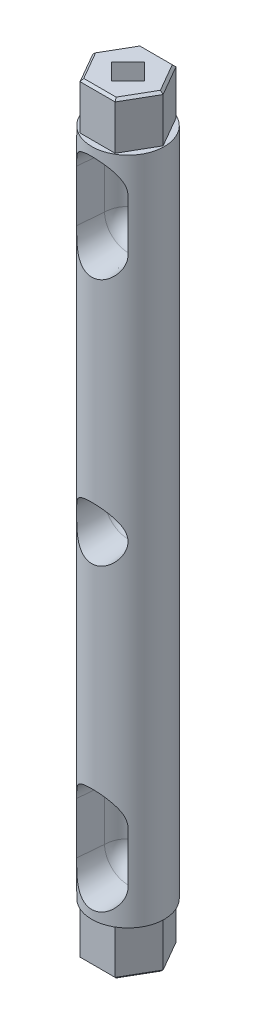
ISO-10303-21;
HEADER;
FILE_DESCRIPTION(('STEP AP214'),'2;1');
FILE_NAME('part.step','',(''),(''),'','','');
FILE_SCHEMA(('AUTOMOTIVE_DESIGN { 1 0 10303 214 1 1 1 1 }'));
ENDSEC;
DATA;
#1=APPLICATION_CONTEXT('core data for automotive mechanical design processes');
#2=APPLICATION_PROTOCOL_DEFINITION('international standard','automotive_design',2000,#1);
#3=PRODUCT_CONTEXT('',#1,'mechanical');
#4=PRODUCT('Part','Part','',(#3));
#5=PRODUCT_RELATED_PRODUCT_CATEGORY('part','',(#4));
#6=PRODUCT_DEFINITION_FORMATION('','',#4);
#7=PRODUCT_DEFINITION_CONTEXT('part definition',#1,'design');
#8=PRODUCT_DEFINITION('design','',#6,#7);
#9=PRODUCT_DEFINITION_SHAPE('','',#8);
#10=(LENGTH_UNIT() NAMED_UNIT(*) SI_UNIT(.MILLI.,.METRE.));
#11=(NAMED_UNIT(*) PLANE_ANGLE_UNIT() SI_UNIT($,.RADIAN.));
#12=(NAMED_UNIT(*) SI_UNIT($,.STERADIAN.) SOLID_ANGLE_UNIT());
#13=UNCERTAINTY_MEASURE_WITH_UNIT(LENGTH_MEASURE(1.E-05),#10,'distance_accuracy_value','');
#14=(GEOMETRIC_REPRESENTATION_CONTEXT(3) GLOBAL_UNCERTAINTY_ASSIGNED_CONTEXT((#13)) GLOBAL_UNIT_ASSIGNED_CONTEXT((#10,
#11,#12)) REPRESENTATION_CONTEXT('',''));
#15=CARTESIAN_POINT('',(0.,0.,0.));
#16=DIRECTION('',(0.,0.,1.));
#17=DIRECTION('',(1.,0.,0.));
#18=AXIS2_PLACEMENT_3D('',#15,#16,#17);
#19=CARTESIAN_POINT('',(0.,0.,0.));
#20=DIRECTION('',(0.,1.,0.));
#21=DIRECTION('',(0.,0.,1.));
#22=AXIS2_PLACEMENT_3D('',#19,#20,#21);
#23=PLANE('',#22);
#24=CARTESIAN_POINT('',(0.,0.,0.));
#25=DIRECTION('',(0.,1.,0.));
#26=DIRECTION('',(0.,0.,1.));
#27=AXIS2_PLACEMENT_3D('',#24,#25,#26);
#28=CIRCLE('',#27,7.75);
#29=CARTESIAN_POINT('',(0.,0.,7.75));
#30=VERTEX_POINT('',#29);
#31=EDGE_CURVE('E437',#30,#30,#28,.T.);
#32=ORIENTED_EDGE('',*,*,#31,.F.);
#33=EDGE_LOOP('',(#32));
#34=FACE_BOUND('',#33,.T.);
#35=DIRECTION('',(0.499999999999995,0.,0.866025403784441));
#36=VECTOR('',#35,1.);
#37=CARTESIAN_POINT('',(3.75000000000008,0.,-6.49519052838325));
#38=LINE('',#37,#36);
#39=CARTESIAN_POINT('',(3.75000000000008,0.,-6.49519052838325));
#40=VERTEX_POINT('',#39);
#41=CARTESIAN_POINT('',(7.5,0.,0.));
#42=VERTEX_POINT('',#41);
#43=EDGE_CURVE('E323',#40,#42,#38,.T.);
#44=ORIENTED_EDGE('',*,*,#43,.F.);
#45=DIRECTION('',(1.,0.,0.));
#46=VECTOR('',#45,1.);
#47=CARTESIAN_POINT('',(-3.74999999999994,0.,-6.49519052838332));
#48=LINE('',#47,#46);
#49=CARTESIAN_POINT('',(-3.74999999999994,0.,-6.49519052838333));
#50=VERTEX_POINT('',#49);
#51=EDGE_CURVE('E344',#50,#40,#48,.T.);
#52=ORIENTED_EDGE('',*,*,#51,.F.);
#53=DIRECTION('',(0.500000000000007,0.,-0.866025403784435));
#54=VECTOR('',#53,1.);
#55=CARTESIAN_POINT('',(-7.5,0.,0.));
#56=LINE('',#55,#54);
#57=CARTESIAN_POINT('',(-7.5,0.,0.));
#58=VERTEX_POINT('',#57);
#59=EDGE_CURVE('E341',#58,#50,#56,.T.);
#60=ORIENTED_EDGE('',*,*,#59,.F.);
#61=DIRECTION('',(-0.499999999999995,0.,-0.866025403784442));
#62=VECTOR('',#61,1.);
#63=CARTESIAN_POINT('',(-3.75000000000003,0.,6.49519052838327));
#64=LINE('',#63,#62);
#65=CARTESIAN_POINT('',(-3.75000000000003,0.,6.49519052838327));
#66=VERTEX_POINT('',#65);
#67=EDGE_CURVE('E338',#66,#58,#64,.T.);
#68=ORIENTED_EDGE('',*,*,#67,.F.);
#69=DIRECTION('',(-1.,0.,0.));
#70=VECTOR('',#69,1.);
#71=CARTESIAN_POINT('',(3.74999999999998,0.,6.4951905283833));
#72=LINE('',#71,#70);
#73=CARTESIAN_POINT('',(3.74999999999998,0.,6.4951905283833));
#74=VERTEX_POINT('',#73);
#75=EDGE_CURVE('E335',#74,#66,#72,.T.);
#76=ORIENTED_EDGE('',*,*,#75,.F.);
#77=DIRECTION('',(-0.500000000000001,0.,0.866025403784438));
#78=VECTOR('',#77,1.);
#79=CARTESIAN_POINT('',(7.5,0.,0.));
#80=LINE('',#79,#78);
#81=EDGE_CURVE('E332',#42,#74,#80,.T.);
#82=ORIENTED_EDGE('',*,*,#81,.F.);
#83=EDGE_LOOP('',(#44,#52,#60,#68,#76,#82));
#84=FACE_BOUND('',#83,.T.);
#85=ADVANCED_FACE('F33',(#34,#84),#23,.F.);
#86=CARTESIAN_POINT('',(0.,143.,0.));
#87=DIRECTION('',(0.,1.,0.));
#88=DIRECTION('',(0.,0.,1.));
#89=AXIS2_PLACEMENT_3D('',#86,#87,#88);
#90=PLANE('',#89);
#91=CARTESIAN_POINT('',(0.,143.,0.));
#92=DIRECTION('',(0.,1.,0.));
#93=DIRECTION('',(0.,0.,1.));
#94=AXIS2_PLACEMENT_3D('',#91,#92,#93);
#95=CIRCLE('',#94,7.75);
#96=CARTESIAN_POINT('',(0.,143.,7.75));
#97=VERTEX_POINT('',#96);
#98=EDGE_CURVE('E446',#97,#97,#95,.T.);
#99=ORIENTED_EDGE('',*,*,#98,.T.);
#100=EDGE_LOOP('',(#99));
#101=FACE_BOUND('',#100,.T.);
#102=DIRECTION('',(-0.500000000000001,0.,-0.866025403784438));
#103=VECTOR('',#102,1.);
#104=CARTESIAN_POINT('',(7.5,143.,0.));
#105=LINE('',#104,#103);
#106=CARTESIAN_POINT('',(7.5,143.,0.));
#107=VERTEX_POINT('',#106);
#108=CARTESIAN_POINT('',(3.74999999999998,143.,-6.4951905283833));
#109=VERTEX_POINT('',#108);
#110=EDGE_CURVE('E362',#107,#109,#105,.T.);
#111=ORIENTED_EDGE('',*,*,#110,.F.);
#112=DIRECTION('',(0.499999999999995,0.,-0.866025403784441));
#113=VECTOR('',#112,1.);
#114=CARTESIAN_POINT('',(3.75000000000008,143.,6.49519052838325));
#115=LINE('',#114,#113);
#116=CARTESIAN_POINT('',(3.75000000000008,143.,6.49519052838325));
#117=VERTEX_POINT('',#116);
#118=EDGE_CURVE('E359',#117,#107,#115,.T.);
#119=ORIENTED_EDGE('',*,*,#118,.F.);
#120=DIRECTION('',(1.,0.,0.));
#121=VECTOR('',#120,1.);
#122=CARTESIAN_POINT('',(-3.74999999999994,143.,6.49519052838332));
#123=LINE('',#122,#121);
#124=CARTESIAN_POINT('',(-3.74999999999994,143.,6.49519052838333));
#125=VERTEX_POINT('',#124);
#126=EDGE_CURVE('E374',#125,#117,#123,.T.);
#127=ORIENTED_EDGE('',*,*,#126,.F.);
#128=DIRECTION('',(0.500000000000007,0.,0.866025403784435));
#129=VECTOR('',#128,1.);
#130=CARTESIAN_POINT('',(-7.5,143.,0.));
#131=LINE('',#130,#129);
#132=CARTESIAN_POINT('',(-7.5,143.,0.));
#133=VERTEX_POINT('',#132);
#134=EDGE_CURVE('E371',#133,#125,#131,.T.);
#135=ORIENTED_EDGE('',*,*,#134,.F.);
#136=DIRECTION('',(-0.499999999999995,0.,0.866025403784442));
#137=VECTOR('',#136,1.);
#138=CARTESIAN_POINT('',(-3.75000000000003,143.,-6.49519052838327));
#139=LINE('',#138,#137);
#140=CARTESIAN_POINT('',(-3.75000000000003,143.,-6.49519052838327));
#141=VERTEX_POINT('',#140);
#142=EDGE_CURVE('E368',#141,#133,#139,.T.);
#143=ORIENTED_EDGE('',*,*,#142,.F.);
#144=DIRECTION('',(-1.,0.,0.));
#145=VECTOR('',#144,1.);
#146=CARTESIAN_POINT('',(3.74999999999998,143.,-6.4951905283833));
#147=LINE('',#146,#145);
#148=EDGE_CURVE('E365',#109,#141,#147,.T.);
#149=ORIENTED_EDGE('',*,*,#148,.F.);
#150=EDGE_LOOP('',(#111,#119,#127,#135,#143,#149));
#151=FACE_BOUND('',#150,.T.);
#152=ADVANCED_FACE('F476',(#101,#151),#90,.T.);
#153=CARTESIAN_POINT('',(0.,143.,0.));
#154=DIRECTION('',(0.,-1.,0.));
#155=DIRECTION('',(0.,0.,-1.));
#156=AXIS2_PLACEMENT_3D('',#153,#154,#155);
#157=CYLINDRICAL_SURFACE('',#156,7.75);
#158=ORIENTED_EDGE('',*,*,#98,.F.);
#159=EDGE_LOOP('',(#158));
#160=FACE_BOUND('',#159,.T.);
#161=ORIENTED_EDGE('',*,*,#31,.T.);
#162=EDGE_LOOP('',(#161));
#163=FACE_BOUND('',#162,.T.);
#164=CARTESIAN_POINT('',(-4.17047449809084,67.8055877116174,6.53220043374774));
#165=CARTESIAN_POINT('',(-3.9748208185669,67.5682380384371,6.65710957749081));
#166=CARTESIAN_POINT('',(-3.75931725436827,67.3467651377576,6.78226970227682));
#167=CARTESIAN_POINT('',(-3.29035210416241,66.9403317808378,7.02179355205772));
#168=CARTESIAN_POINT('',(-3.03683326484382,66.75542739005,7.13614056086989));
#169=CARTESIAN_POINT('',(-2.53838219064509,66.455441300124,7.32654281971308));
#170=CARTESIAN_POINT('',(-2.29862070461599,66.3339136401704,7.40579867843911));
#171=CARTESIAN_POINT('',(-1.92371815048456,66.1785022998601,7.5085733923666));
#172=CARTESIAN_POINT('',(-1.79621377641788,66.1311801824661,7.54014564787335));
#173=CARTESIAN_POINT('',(-1.53677647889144,66.0460605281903,7.59726416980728));
#174=CARTESIAN_POINT('',(-1.40484554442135,66.0082587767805,7.62281310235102));
#175=CARTESIAN_POINT('',(-1.13648299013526,65.9425050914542,7.66743379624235));
#176=CARTESIAN_POINT('',(-1.00002661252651,65.9146228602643,7.68645968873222));
#177=CARTESIAN_POINT('',(-0.724546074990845,65.8695351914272,7.71730118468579));
#178=CARTESIAN_POINT('',(-0.58552189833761,65.8523298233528,7.72911674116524));
#179=CARTESIAN_POINT('',(-0.306149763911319,65.8289094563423,7.74521431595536));
#180=CARTESIAN_POINT('',(-0.165802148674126,65.8226916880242,7.7494982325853));
#181=CARTESIAN_POINT('',(0.114963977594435,65.8213551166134,7.75041839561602));
#182=CARTESIAN_POINT('',(0.255382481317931,65.8262353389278,7.74705531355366));
#183=CARTESIAN_POINT('',(0.519995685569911,65.8458834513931,7.73354583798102));
#184=CARTESIAN_POINT('',(0.644314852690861,65.8595344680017,7.7241658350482));
#185=CARTESIAN_POINT('',(0.891167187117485,65.8954104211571,7.69959164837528));
#186=CARTESIAN_POINT('',(1.01369975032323,65.9176381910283,7.68439554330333));
#187=CARTESIAN_POINT('',(1.25611140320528,65.9703608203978,7.64850885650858));
#188=CARTESIAN_POINT('',(1.37599128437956,66.0008531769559,7.62781993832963));
#189=CARTESIAN_POINT('',(1.61247205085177,66.0697242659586,7.58135778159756));
#190=CARTESIAN_POINT('',(1.72907164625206,66.108106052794,7.55558257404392));
#191=CARTESIAN_POINT('',(2.07983435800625,66.2369604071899,7.46965277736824));
#192=CARTESIAN_POINT('',(2.30783936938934,66.3395766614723,7.40198021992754));
#193=CARTESIAN_POINT('',(2.74364697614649,66.5724675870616,7.25177308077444));
#194=CARTESIAN_POINT('',(2.95144445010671,66.7027492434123,7.16923474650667));
#195=CARTESIAN_POINT('',(3.37666042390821,67.0103071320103,6.98019155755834));
#196=CARTESIAN_POINT('',(3.5902805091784,67.191768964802,6.8719658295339));
#197=CARTESIAN_POINT('',(3.98668876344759,67.583320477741,6.64985123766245));
#198=CARTESIAN_POINT('',(4.16942507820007,67.7934572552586,6.53595325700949));
#199=CARTESIAN_POINT('',(4.43417313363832,68.1479507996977,6.35725533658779));
#200=CARTESIAN_POINT('',(4.5267868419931,68.2840030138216,6.29145081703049));
#201=CARTESIAN_POINT('',(4.70038384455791,68.5646758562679,6.16283844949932));
#202=CARTESIAN_POINT('',(4.7813643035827,68.7092985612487,6.10003133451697));
#203=CARTESIAN_POINT('',(5.00588861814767,69.1551131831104,5.91948184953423));
#204=CARTESIAN_POINT('',(5.13155384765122,69.4689692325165,5.80922862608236));
#205=CARTESIAN_POINT('',(5.30009443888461,70.0300893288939,5.65515150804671));
#206=CARTESIAN_POINT('',(5.35638487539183,70.2705563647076,5.60134229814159));
#207=CARTESIAN_POINT('',(5.41810921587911,70.6381910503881,5.54142238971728));
#208=CARTESIAN_POINT('',(5.43489614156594,70.761830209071,5.52491769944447));
#209=CARTESIAN_POINT('',(5.46068706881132,71.0107137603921,5.49943110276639));
#210=CARTESIAN_POINT('',(5.46969101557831,71.1359581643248,5.49044924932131));
#211=CARTESIAN_POINT('',(5.4797701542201,71.3875519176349,5.48038937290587));
#212=CARTESIAN_POINT('',(5.48081565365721,71.5139036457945,5.47934094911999));
#213=CARTESIAN_POINT('',(5.4748826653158,71.7662255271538,5.48526913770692));
#214=CARTESIAN_POINT('',(5.46790429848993,71.8921956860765,5.49224562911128));
#215=CARTESIAN_POINT('',(5.44603698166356,72.1428901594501,5.5139292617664));
#216=CARTESIAN_POINT('',(5.43114045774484,72.2676131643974,5.52864380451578));
#217=CARTESIAN_POINT('',(5.39366694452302,72.5148871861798,5.56520785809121));
#218=CARTESIAN_POINT('',(5.37108596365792,72.6374370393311,5.5870610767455));
#219=CARTESIAN_POINT('',(5.31360181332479,72.9024592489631,5.64180769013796));
#220=CARTESIAN_POINT('',(5.27717829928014,73.0443327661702,5.67600563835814));
#221=CARTESIAN_POINT('',(5.19446686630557,73.323205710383,5.75179587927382));
#222=CARTESIAN_POINT('',(5.14817246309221,73.4602018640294,5.79339302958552));
#223=CARTESIAN_POINT('',(5.04621024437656,73.7288371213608,5.88241791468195));
#224=CARTESIAN_POINT('',(4.99053407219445,73.8604713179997,5.92985083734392));
#225=CARTESIAN_POINT('',(4.87030212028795,74.1178656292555,6.02899148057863));
#226=CARTESIAN_POINT('',(4.80574781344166,74.2436267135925,6.08069849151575));
#227=CARTESIAN_POINT('',(4.59669692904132,74.6163918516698,6.24212903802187));
#228=CARTESIAN_POINT('',(4.43868289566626,74.8539811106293,6.35644537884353));
#229=CARTESIAN_POINT('',(4.08893819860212,75.302126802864,6.58688025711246));
#230=CARTESIAN_POINT('',(3.89718765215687,75.5126671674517,6.70299982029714));
#231=CARTESIAN_POINT('',(3.56588161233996,75.8239985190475,6.88235032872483));
#232=CARTESIAN_POINT('',(3.43673773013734,75.9346458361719,6.94791520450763));
#233=CARTESIAN_POINT('',(3.16730756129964,76.1443557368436,7.07480157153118));
#234=CARTESIAN_POINT('',(3.02701901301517,76.2434159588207,7.13612219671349));
#235=CARTESIAN_POINT('',(2.73609516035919,76.4286211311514,7.25264130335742));
#236=CARTESIAN_POINT('',(2.58547623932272,76.5147858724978,7.30784913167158));
#237=CARTESIAN_POINT('',(2.27454476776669,76.6730568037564,7.41051340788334));
#238=CARTESIAN_POINT('',(2.11423695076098,76.7451697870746,7.45797359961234));
#239=CARTESIAN_POINT('',(1.83261109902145,76.8554110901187,7.53118163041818));
#240=CARTESIAN_POINT('',(1.71336901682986,76.8973444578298,7.55924519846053));
#241=CARTESIAN_POINT('',(1.47119489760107,76.9729247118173,7.61008414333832));
#242=CARTESIAN_POINT('',(1.34826363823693,77.0065733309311,7.63286062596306));
#243=CARTESIAN_POINT('',(1.0995096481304,77.0651312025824,7.67264184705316));
#244=CARTESIAN_POINT('',(0.973689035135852,77.0900466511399,7.68965067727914));
#245=CARTESIAN_POINT('',(0.719907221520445,77.1308185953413,7.71754672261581));
#246=CARTESIAN_POINT('',(0.591945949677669,77.1466747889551,7.72843373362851));
#247=CARTESIAN_POINT('',(0.334451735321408,77.1691175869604,7.7438572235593));
#248=CARTESIAN_POINT('',(0.204915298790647,77.1756770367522,7.74837509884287));
#249=CARTESIAN_POINT('',(-0.0543539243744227,77.179335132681,7.75089363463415));
#250=CARTESIAN_POINT('',(-0.184086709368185,77.1764338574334,7.74889434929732));
#251=CARTESIAN_POINT('',(-0.442755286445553,77.1612156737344,7.73842527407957));
#252=CARTESIAN_POINT('',(-0.571690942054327,77.1488971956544,7.72995440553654));
#253=CARTESIAN_POINT('',(-0.827765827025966,77.1150355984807,7.70673956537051));
#254=CARTESIAN_POINT('',(-0.95490507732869,77.0934925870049,7.69199566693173));
#255=CARTESIAN_POINT('',(-1.20141335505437,77.0425489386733,7.657281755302));
#256=CARTESIAN_POINT('',(-1.32088874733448,77.0135010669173,7.63754704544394));
#257=CARTESIAN_POINT('',(-1.55670079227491,76.9475679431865,7.59299721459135));
#258=CARTESIAN_POINT('',(-1.67303642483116,76.9106801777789,7.56818046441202));
#259=CARTESIAN_POINT('',(-2.01636615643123,76.7888791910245,7.48678536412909));
#260=CARTESIAN_POINT('',(-2.2378574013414,76.6927915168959,7.4232366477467));
#261=CARTESIAN_POINT('',(-2.6835680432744,76.4635767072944,7.27472552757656));
#262=CARTESIAN_POINT('',(-2.90585297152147,76.3277097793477,7.18825884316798));
#263=CARTESIAN_POINT('',(-3.32589300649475,76.0285695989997,7.0038284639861));
#264=CARTESIAN_POINT('',(-3.52362996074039,75.8652762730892,6.90585636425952));
#265=CARTESIAN_POINT('',(-3.92791630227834,75.4817336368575,6.68553828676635));
#266=CARTESIAN_POINT('',(-4.12916099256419,75.256546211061,6.56206754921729));
#267=CARTESIAN_POINT('',(-4.49383965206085,74.775572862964,6.31791148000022));
#268=CARTESIAN_POINT('',(-4.65724804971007,74.5197664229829,6.19722808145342));
#269=CARTESIAN_POINT('',(-4.8646783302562,74.1288900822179,6.03358729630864));
#270=CARTESIAN_POINT('',(-4.92492293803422,74.0048199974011,5.98439536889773));
#271=CARTESIAN_POINT('',(-5.03689870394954,73.7512027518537,5.89045661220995));
#272=CARTESIAN_POINT('',(-5.0886289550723,73.6216550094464,5.84571025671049));
#273=CARTESIAN_POINT('',(-5.18305350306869,73.357669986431,5.76215515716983));
#274=CARTESIAN_POINT('',(-5.22576090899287,73.2232401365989,5.72333782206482));
#275=CARTESIAN_POINT('',(-5.30171743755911,72.9499177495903,5.65304999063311));
#276=CARTESIAN_POINT('',(-5.33497246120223,72.8110280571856,5.62157491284));
#277=CARTESIAN_POINT('',(-5.38682047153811,72.5530244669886,5.57186956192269));
#278=CARTESIAN_POINT('',(-5.40693327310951,72.4344718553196,5.55230621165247));
#279=CARTESIAN_POINT('',(-5.43997753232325,72.1955001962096,5.519935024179));
#280=CARTESIAN_POINT('',(-5.4529124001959,72.0750820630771,5.50712397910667));
#281=CARTESIAN_POINT('',(-5.47140720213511,71.8332124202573,5.48874984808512));
#282=CARTESIAN_POINT('',(-5.47697243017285,71.7117617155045,5.48318155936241));
#283=CARTESIAN_POINT('',(-5.48065334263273,71.468631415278,5.47950230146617));
#284=CARTESIAN_POINT('',(-5.47876887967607,71.3469518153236,5.48139147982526));
#285=CARTESIAN_POINT('',(-5.46758690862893,71.1044323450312,5.49254559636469));
#286=CARTESIAN_POINT('',(-5.45829903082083,70.9835915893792,5.50180095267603));
#287=CARTESIAN_POINT('',(-5.43247606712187,70.7434148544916,5.52729773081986));
#288=CARTESIAN_POINT('',(-5.41593833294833,70.6240794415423,5.54354170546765));
#289=CARTESIAN_POINT('',(-5.35572419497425,70.2691357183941,5.60195726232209));
#290=CARTESIAN_POINT('',(-5.30145835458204,70.0368261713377,5.65379977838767));
#291=CARTESIAN_POINT('',(-5.14474472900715,69.5101095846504,5.79729985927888));
#292=CARTESIAN_POINT('',(-5.03226500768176,69.2208219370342,5.89646918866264));
#293=CARTESIAN_POINT('',(-4.76640873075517,68.6699225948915,6.11335983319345));
#294=CARTESIAN_POINT('',(-4.6130673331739,68.4082873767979,6.23106516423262));
#295=CARTESIAN_POINT('',(-4.39811710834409,68.1004729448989,6.38136417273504));
#296=CARTESIAN_POINT('',(-4.35421094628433,68.0401886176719,6.41141857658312));
#297=CARTESIAN_POINT('',(-4.26408257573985,67.9214885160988,6.47171057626));
#298=CARTESIAN_POINT('',(-4.21786071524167,67.8630724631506,6.50194814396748));
#299=CARTESIAN_POINT('',(-4.17047449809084,67.8055877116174,6.53220043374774));
#300=B_SPLINE_CURVE_WITH_KNOTS('',3,(#164,#165,#166,#167,#168,#169,#170,#171,#172,#173,#174,
#175,#176,#177,#178,#179,#180,#181,#182,#183,#184,#185,#186,#187,#188,#189,#190,#191,#192,#193,
#194,#195,#196,#197,#198,#199,#200,#201,#202,#203,#204,#205,#206,#207,#208,#209,#210,#211,#212,
#213,#214,#215,#216,#217,#218,#219,#220,#221,#222,#223,#224,#225,#226,#227,#228,#229,#230,#231,
#232,#233,#234,#235,#236,#237,#238,#239,#240,#241,#242,#243,#244,#245,#246,#247,#248,#249,#250,
#251,#252,#253,#254,#255,#256,#257,#258,#259,#260,#261,#262,#263,#264,#265,#266,#267,#268,#269,
#270,#271,#272,#273,#274,#275,#276,#277,#278,#279,#280,#281,#282,#283,#284,#285,#286,#287,#288,
#289,#290,#291,#292,#293,#294,#295,#296,#297,#298,#299),.UNSPECIFIED.,.T.,.F.,(4,2,2,2,2,2,2,2,
2,2,2,2,2,2,2,2,2,2,2,2,2,2,2,2,2,2,2,2,2,2,2,2,2,2,2,2,2,2,2,2,2,2,2,2,2,2,2,2,2,2,2,2,2,2,2,2,
2,2,2,2,2,2,2,2,2,2,2,4),(0.,0.995700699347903,1.99291633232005,2.82982987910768,
3.24824620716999,3.66647698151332,4.08759109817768,4.50870795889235,4.92971866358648,
5.35069239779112,5.72650568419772,6.10244322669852,6.47826704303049,6.85423663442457,
7.6280487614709,8.40205649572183,9.30015236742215,10.1997414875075,10.7309185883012,
11.2622249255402,12.32194669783,13.0769980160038,13.4541592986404,13.8313232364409,
14.2098936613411,14.5884583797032,14.9673858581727,15.3465104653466,15.7970965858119,
16.2479796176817,16.6992664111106,17.1504784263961,18.0692873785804,18.988639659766,
19.5347756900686,20.081022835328,20.6264228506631,21.1715585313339,21.5596089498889,
21.9475781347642,22.335271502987,22.7229777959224,23.1118142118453,23.5006473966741,
23.8895454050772,24.2784388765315,24.6516147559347,25.024910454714,25.7709678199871,
26.5914938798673,27.4126231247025,28.3877811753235,29.3635963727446,29.8025707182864,
30.2415917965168,30.6799705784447,31.1180750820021,31.4831753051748,31.8481019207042,
32.2127662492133,32.5774377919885,32.941635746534,33.305966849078,34.0353309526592,
35.0078666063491,35.9795681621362,36.2207573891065,36.4619104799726),.UNSPECIFIED.);
#301=CARTESIAN_POINT('',(-4.17047449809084,67.8055877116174,6.53220043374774));
#302=VERTEX_POINT('',#301);
#303=EDGE_CURVE('E449',#302,#302,#300,.T.);
#304=ORIENTED_EDGE('',*,*,#303,.F.);
#305=EDGE_LOOP('',(#304));
#306=FACE_BOUND('',#305,.T.);
#307=CARTESIAN_POINT('',(-5.47949556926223,124.5002,5.48065947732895));
#308=CARTESIAN_POINT('',(-5.47953161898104,124.363507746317,5.48057590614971));
#309=CARTESIAN_POINT('',(-5.474802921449,124.22685957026,5.48535056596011));
#310=CARTESIAN_POINT('',(-5.45606719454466,123.955004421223,5.50401147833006));
#311=CARTESIAN_POINT('',(-5.44207258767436,123.81979576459,5.51788553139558));
#312=CARTESIAN_POINT('',(-5.40523509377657,123.553104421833,5.55396693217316));
#313=CARTESIAN_POINT('',(-5.38247962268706,123.421598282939,5.57609188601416));
#314=CARTESIAN_POINT('',(-5.32849178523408,123.161792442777,5.62770619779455));
#315=CARTESIAN_POINT('',(-5.29725691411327,123.033493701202,5.65719773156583));
#316=CARTESIAN_POINT('',(-5.22690390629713,122.781435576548,5.72225916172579));
#317=CARTESIAN_POINT('',(-5.18782773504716,122.657656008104,5.75779655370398));
#318=CARTESIAN_POINT('',(-5.10209720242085,122.414396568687,5.83390068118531));
#319=CARTESIAN_POINT('',(-5.05544326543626,122.29491645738,5.87446713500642));
#320=CARTESIAN_POINT('',(-4.90432994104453,121.94266461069,6.00228467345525));
#321=CARTESIAN_POINT('',(-4.78887531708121,121.716633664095,6.09550238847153));
#322=CARTESIAN_POINT('',(-4.58348627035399,121.372541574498,6.25006771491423));
#323=CARTESIAN_POINT('',(-4.50228338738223,121.247971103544,6.30894933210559));
#324=CARTESIAN_POINT('',(-4.33061249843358,121.00603156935,6.42800282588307));
#325=CARTESIAN_POINT('',(-4.24014354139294,120.888663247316,6.48817483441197));
#326=CARTESIAN_POINT('',(-3.95495403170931,120.547688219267,6.66868223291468));
#327=CARTESIAN_POINT('',(-3.74645226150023,120.335213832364,6.78900788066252));
#328=CARTESIAN_POINT('',(-3.39227838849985,120.028901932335,6.96963669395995));
#329=CARTESIAN_POINT('',(-3.25824649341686,119.923394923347,7.03346211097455));
#330=CARTESIAN_POINT('',(-2.9792421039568,119.724418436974,7.15610222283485));
#331=CARTESIAN_POINT('',(-2.83426759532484,119.630951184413,7.21491599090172));
#332=CARTESIAN_POINT('',(-2.53437239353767,119.457504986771,7.32563780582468));
#333=CARTESIAN_POINT('',(-2.37947139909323,119.377500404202,7.37755893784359));
#334=CARTESIAN_POINT('',(-2.06048477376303,119.232128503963,7.47292217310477));
#335=CARTESIAN_POINT('',(-1.89640386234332,119.16675374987,7.51636858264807));
#336=CARTESIAN_POINT('',(-1.61036101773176,119.069019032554,7.58181648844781));
#337=CARTESIAN_POINT('',(-1.49034277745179,119.032618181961,7.60635636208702));
#338=CARTESIAN_POINT('',(-1.2471269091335,118.968154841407,7.64999509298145));
#339=CARTESIAN_POINT('',(-1.12392996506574,118.940090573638,7.66909511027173));
#340=CARTESIAN_POINT('',(-0.875190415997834,118.89268837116,7.70144546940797));
#341=CARTESIAN_POINT('',(-0.749649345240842,118.873344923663,7.71469950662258));
#342=CARTESIAN_POINT('',(-0.497006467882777,118.843636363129,7.73508525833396));
#343=CARTESIAN_POINT('',(-0.369904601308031,118.833271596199,7.74221673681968));
#344=CARTESIAN_POINT('',(-0.114862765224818,118.821669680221,7.75020078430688));
#345=CARTESIAN_POINT('',(0.0130782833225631,118.820448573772,7.75104231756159));
#346=CARTESIAN_POINT('',(0.268647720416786,118.82719635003,7.74639716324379));
#347=CARTESIAN_POINT('',(0.396275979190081,118.835168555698,7.74090818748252));
#348=CARTESIAN_POINT('',(0.650196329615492,118.860184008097,7.72372552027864));
#349=CARTESIAN_POINT('',(0.776488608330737,118.877225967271,7.71203270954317));
#350=CARTESIAN_POINT('',(1.02690669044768,118.920135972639,7.68269903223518));
#351=CARTESIAN_POINT('',(1.15103163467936,118.946007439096,7.665055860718));
#352=CARTESIAN_POINT('',(1.39354293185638,119.005551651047,7.62465139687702));
#353=CARTESIAN_POINT('',(1.511995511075,119.039038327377,7.60201250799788));
#354=CARTESIAN_POINT('',(1.74540289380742,119.113709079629,7.55184362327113));
#355=CARTESIAN_POINT('',(1.86035647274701,119.154895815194,7.52431193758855));
#356=CARTESIAN_POINT('',(2.19907387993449,119.289338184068,7.43511745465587));
#357=CARTESIAN_POINT('',(2.4168640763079,119.393518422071,7.36682591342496));
#358=CARTESIAN_POINT('',(2.85755172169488,119.641024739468,7.20819482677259));
#359=CARTESIAN_POINT('',(3.07805843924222,119.787506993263,7.11620959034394));
#360=CARTESIAN_POINT('',(3.49306956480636,120.107970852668,6.92196254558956));
#361=CARTESIAN_POINT('',(3.68755053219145,120.281976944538,6.8196916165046));
#362=CARTESIAN_POINT('',(4.08382242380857,120.689869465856,6.59139682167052));
#363=CARTESIAN_POINT('',(4.27995572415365,120.928849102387,6.46455773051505));
#364=CARTESIAN_POINT('',(4.54377570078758,121.310428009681,6.27919123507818));
#365=CARTESIAN_POINT('',(4.62669794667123,121.44156866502,6.21817832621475));
#366=CARTESIAN_POINT('',(4.78210437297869,121.711306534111,6.09946913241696));
#367=CARTESIAN_POINT('',(4.85458927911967,121.849903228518,6.04177261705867));
#368=CARTESIAN_POINT('',(5.03453579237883,122.231594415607,5.89383385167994));
#369=CARTESIAN_POINT('',(5.13209362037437,122.481434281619,5.80826281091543));
#370=CARTESIAN_POINT('',(5.25276524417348,122.868780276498,5.69858926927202));
#371=CARTESIAN_POINT('',(5.28868134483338,122.999813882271,5.66517677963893));
#372=CARTESIAN_POINT('',(5.35162322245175,123.265620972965,5.60575568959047));
#373=CARTESIAN_POINT('',(5.37865278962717,123.400392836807,5.57974393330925));
#374=CARTESIAN_POINT('',(5.42689755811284,123.694268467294,5.53286661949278));
#375=CARTESIAN_POINT('',(5.44653731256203,123.853874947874,5.51344677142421));
#376=CARTESIAN_POINT('',(5.46626997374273,124.095063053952,5.49385731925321));
#377=CARTESIAN_POINT('',(5.4712264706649,124.175907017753,5.48891730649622));
#378=CARTESIAN_POINT('',(5.47784217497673,124.337894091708,5.48231306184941));
#379=CARTESIAN_POINT('',(5.47950010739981,124.419037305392,5.48065009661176));
#380=CARTESIAN_POINT('',(5.47949556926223,124.5002,5.48065947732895));
#381=B_SPLINE_CURVE_WITH_KNOTS('',3,(#307,#308,#309,#310,#311,#312,#313,#314,#315,#316,#317,
#318,#319,#320,#321,#322,#323,#324,#325,#326,#327,#328,#329,#330,#331,#332,#333,#334,#335,#336,
#337,#338,#339,#340,#341,#342,#343,#344,#345,#346,#347,#348,#349,#350,#351,#352,#353,#354,#355,
#356,#357,#358,#359,#360,#361,#362,#363,#364,#365,#366,#367,#368,#369,#370,#371,#372,#373,#374,
#375,#376,#377,#378,#379,#380),.UNSPECIFIED.,.F.,.F.,(4,2,2,2,2,2,2,2,2,2,2,2,2,2,2,2,2,2,2,2,2,
2,2,2,2,2,2,2,2,2,2,2,2,2,2,2,4),(0.,0.409840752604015,0.81913315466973,1.22444326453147,
1.62987323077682,2.03318864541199,2.43648148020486,3.24483223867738,3.7242631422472,
4.20374330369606,5.16271251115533,5.70846201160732,6.25431221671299,6.7991108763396,
7.34363197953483,7.72663108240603,8.1095484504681,8.4922234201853,8.87491314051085,
9.25827413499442,9.64177374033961,10.0252189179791,10.4088127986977,10.7838853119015,
11.159087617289,11.9089657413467,12.7466931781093,13.5851701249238,14.5832815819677,
15.0830107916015,15.5827052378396,16.4235306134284,16.8428487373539,17.2619877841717,
17.7468243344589,17.9901464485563,18.2335625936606),.UNSPECIFIED.);
#382=CARTESIAN_POINT('',(-5.47949557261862,124.5,5.48065947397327));
#383=VERTEX_POINT('',#382);
#384=CARTESIAN_POINT('',(5.47949557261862,124.5,5.48065947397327));
#385=VERTEX_POINT('',#384);
#386=EDGE_CURVE('E458',#383,#385,#381,.T.);
#387=ORIENTED_EDGE('',*,*,#386,.F.);
#388=DIRECTION('',(0.,-1.,0.));
#389=VECTOR('',#388,1.);
#390=CARTESIAN_POINT('',(-5.47949557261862,143.,5.48065947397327));
#391=LINE('',#390,#389);
#392=CARTESIAN_POINT('',(-5.47949557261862,135.5,5.48065947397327));
#393=VERTEX_POINT('',#392);
#394=EDGE_CURVE('E1109',#393,#383,#391,.T.);
#395=ORIENTED_EDGE('',*,*,#394,.F.);
#396=CARTESIAN_POINT('',(5.47949556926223,135.4998,5.48065947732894));
#397=CARTESIAN_POINT('',(5.47953161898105,135.636492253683,5.4805759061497));
#398=CARTESIAN_POINT('',(5.474802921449,135.77314042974,5.48535056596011));
#399=CARTESIAN_POINT('',(5.45606719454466,136.044995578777,5.50401147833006));
#400=CARTESIAN_POINT('',(5.44207258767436,136.180204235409,5.51788553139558));
#401=CARTESIAN_POINT('',(5.40523509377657,136.446895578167,5.55396693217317));
#402=CARTESIAN_POINT('',(5.38247962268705,136.578401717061,5.57609188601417));
#403=CARTESIAN_POINT('',(5.32849178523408,136.838207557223,5.62770619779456));
#404=CARTESIAN_POINT('',(5.29725691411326,136.966506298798,5.65719773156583));
#405=CARTESIAN_POINT('',(5.22690390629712,137.218564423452,5.72225916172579));
#406=CARTESIAN_POINT('',(5.18782773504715,137.342343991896,5.75779655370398));
#407=CARTESIAN_POINT('',(5.10209720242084,137.585603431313,5.83390068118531));
#408=CARTESIAN_POINT('',(5.05544326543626,137.70508354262,5.87446713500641));
#409=CARTESIAN_POINT('',(4.90432994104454,138.05733538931,6.00228467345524));
#410=CARTESIAN_POINT('',(4.78887531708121,138.283366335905,6.09550238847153));
#411=CARTESIAN_POINT('',(4.58348627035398,138.627458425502,6.25006771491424));
#412=CARTESIAN_POINT('',(4.50228338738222,138.752028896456,6.30894933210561));
#413=CARTESIAN_POINT('',(4.33061249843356,138.99396843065,6.42800282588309));
#414=CARTESIAN_POINT('',(4.24014354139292,139.111336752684,6.48817483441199));
#415=CARTESIAN_POINT('',(3.95495403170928,139.452311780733,6.6686822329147));
#416=CARTESIAN_POINT('',(3.7464522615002,139.664786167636,6.78900788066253));
#417=CARTESIAN_POINT('',(3.39227838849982,139.971098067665,6.96963669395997));
#418=CARTESIAN_POINT('',(3.25824649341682,140.076605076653,7.03346211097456));
#419=CARTESIAN_POINT('',(2.97924210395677,140.275581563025,7.15610222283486));
#420=CARTESIAN_POINT('',(2.8342675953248,140.369048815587,7.21491599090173));
#421=CARTESIAN_POINT('',(2.53437239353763,140.542495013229,7.3256378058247));
#422=CARTESIAN_POINT('',(2.37947139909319,140.622499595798,7.37755893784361));
#423=CARTESIAN_POINT('',(2.06048477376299,140.767871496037,7.47292217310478));
#424=CARTESIAN_POINT('',(1.89640386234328,140.83324625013,7.51636858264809));
#425=CARTESIAN_POINT('',(1.61036101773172,140.930980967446,7.58181648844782));
#426=CARTESIAN_POINT('',(1.49034277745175,140.967381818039,7.60635636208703));
#427=CARTESIAN_POINT('',(1.24712690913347,141.031845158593,7.64999509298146));
#428=CARTESIAN_POINT('',(1.1239299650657,141.059909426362,7.66909511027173));
#429=CARTESIAN_POINT('',(0.875190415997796,141.10731162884,7.70144546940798));
#430=CARTESIAN_POINT('',(0.749649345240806,141.126655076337,7.71469950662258));
#431=CARTESIAN_POINT('',(0.497006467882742,141.156363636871,7.73508525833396));
#432=CARTESIAN_POINT('',(0.369904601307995,141.166728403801,7.74221673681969));
#433=CARTESIAN_POINT('',(0.114862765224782,141.178330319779,7.75020078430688));
#434=CARTESIAN_POINT('',(-0.0130782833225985,141.179551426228,7.75104231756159));
#435=CARTESIAN_POINT('',(-0.268647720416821,141.17280364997,7.74639716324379));
#436=CARTESIAN_POINT('',(-0.396275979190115,141.164831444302,7.74090818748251));
#437=CARTESIAN_POINT('',(-0.650196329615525,141.139815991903,7.72372552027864));
#438=CARTESIAN_POINT('',(-0.776488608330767,141.122774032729,7.71203270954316));
#439=CARTESIAN_POINT('',(-1.02690669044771,141.079864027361,7.68269903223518));
#440=CARTESIAN_POINT('',(-1.15103163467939,141.053992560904,7.665055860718));
#441=CARTESIAN_POINT('',(-1.39354293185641,140.994448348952,7.62465139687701));
#442=CARTESIAN_POINT('',(-1.51199551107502,140.960961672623,7.60201250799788));
#443=CARTESIAN_POINT('',(-1.74540289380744,140.88629092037,7.55184362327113));
#444=CARTESIAN_POINT('',(-1.86035647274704,140.845104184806,7.52431193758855));
#445=CARTESIAN_POINT('',(-2.19907387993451,140.710661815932,7.43511745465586));
#446=CARTESIAN_POINT('',(-2.41686407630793,140.606481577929,7.36682591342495));
#447=CARTESIAN_POINT('',(-2.85755172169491,140.358975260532,7.20819482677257));
#448=CARTESIAN_POINT('',(-3.07805843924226,140.212493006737,7.11620959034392));
#449=CARTESIAN_POINT('',(-3.49306956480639,139.892029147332,6.92196254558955));
#450=CARTESIAN_POINT('',(-3.68755053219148,139.718023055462,6.81969161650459));
#451=CARTESIAN_POINT('',(-4.0838224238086,139.310130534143,6.59139682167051));
#452=CARTESIAN_POINT('',(-4.27995572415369,139.071150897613,6.46455773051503));
#453=CARTESIAN_POINT('',(-4.54377570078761,138.689571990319,6.27919123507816));
#454=CARTESIAN_POINT('',(-4.62669794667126,138.55843133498,6.21817832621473));
#455=CARTESIAN_POINT('',(-4.78210437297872,138.288693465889,6.09946913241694));
#456=CARTESIAN_POINT('',(-4.8545892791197,138.150096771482,6.04177261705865));
#457=CARTESIAN_POINT('',(-5.03453579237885,137.768405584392,5.89383385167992));
#458=CARTESIAN_POINT('',(-5.13209362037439,137.518565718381,5.80826281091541));
#459=CARTESIAN_POINT('',(-5.2527652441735,137.131219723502,5.698589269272));
#460=CARTESIAN_POINT('',(-5.2886813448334,137.000186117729,5.66517677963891));
#461=CARTESIAN_POINT('',(-5.35162322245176,136.734379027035,5.60575568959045));
#462=CARTESIAN_POINT('',(-5.37865278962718,136.599607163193,5.57974393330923));
#463=CARTESIAN_POINT('',(-5.42689755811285,136.305731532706,5.53286661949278));
#464=CARTESIAN_POINT('',(-5.44653731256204,136.146125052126,5.5134467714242));
#465=CARTESIAN_POINT('',(-5.46626997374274,135.904936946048,5.49385731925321));
#466=CARTESIAN_POINT('',(-5.4712264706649,135.824092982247,5.48891730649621));
#467=CARTESIAN_POINT('',(-5.47784217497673,135.662105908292,5.48231306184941));
#468=CARTESIAN_POINT('',(-5.47950010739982,135.580962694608,5.48065009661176));
#469=CARTESIAN_POINT('',(-5.47949556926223,135.4998,5.48065947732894));
#470=B_SPLINE_CURVE_WITH_KNOTS('',3,(#396,#397,#398,#399,#400,#401,#402,#403,#404,#405,#406,
#407,#408,#409,#410,#411,#412,#413,#414,#415,#416,#417,#418,#419,#420,#421,#422,#423,#424,#425,
#426,#427,#428,#429,#430,#431,#432,#433,#434,#435,#436,#437,#438,#439,#440,#441,#442,#443,#444,
#445,#446,#447,#448,#449,#450,#451,#452,#453,#454,#455,#456,#457,#458,#459,#460,#461,#462,#463,
#464,#465,#466,#467,#468,#469),.UNSPECIFIED.,.F.,.F.,(4,2,2,2,2,2,2,2,2,2,2,2,2,2,2,2,2,2,2,2,2,
2,2,2,2,2,2,2,2,2,2,2,2,2,2,2,4),(0.,0.409840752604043,0.819133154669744,1.22444326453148,
1.62987323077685,2.03318864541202,2.43648148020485,3.2448322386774,3.72426314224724,
4.20374330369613,5.16271251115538,5.70846201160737,6.25431221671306,6.79911087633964,
7.34363197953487,7.72663108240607,8.10954845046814,8.49222342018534,8.87491314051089,
9.25827413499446,9.64177374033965,10.0252189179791,10.4088127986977,10.7838853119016,
11.159087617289,11.9089657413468,12.7466931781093,13.5851701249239,14.5832815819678,
15.0830107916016,15.5827052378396,16.4235306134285,16.8428487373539,17.2619877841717,
17.746824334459,17.9901464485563,18.2335625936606),.UNSPECIFIED.);
#471=CARTESIAN_POINT('',(5.47949557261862,135.5,5.48065947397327));
#472=VERTEX_POINT('',#471);
#473=EDGE_CURVE('E1132',#472,#393,#470,.T.);
#474=ORIENTED_EDGE('',*,*,#473,.F.);
#475=DIRECTION('',(0.,-1.,0.));
#476=VECTOR('',#475,1.);
#477=CARTESIAN_POINT('',(5.47949557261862,143.,5.48065947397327));
#478=LINE('',#477,#476);
#479=EDGE_CURVE('E1137',#385,#472,#478,.F.);
#480=ORIENTED_EDGE('',*,*,#479,.F.);
#481=EDGE_LOOP('',(#387,#395,#474,#480));
#482=FACE_BOUND('',#481,.T.);
#483=CARTESIAN_POINT('',(-5.47949556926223,7.50020000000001,5.48065947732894));
#484=CARTESIAN_POINT('',(-5.47953161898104,7.36350774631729,5.48057590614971));
#485=CARTESIAN_POINT('',(-5.474802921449,7.22685957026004,5.48535056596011));
#486=CARTESIAN_POINT('',(-5.45606719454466,6.95500442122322,5.50401147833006));
#487=CARTESIAN_POINT('',(-5.44207258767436,6.81979576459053,5.51788553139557));
#488=CARTESIAN_POINT('',(-5.40523509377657,6.5531044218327,5.55396693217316));
#489=CARTESIAN_POINT('',(-5.38247962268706,6.42159828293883,5.57609188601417));
#490=CARTESIAN_POINT('',(-5.32849178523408,6.16179244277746,5.62770619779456));
#491=CARTESIAN_POINT('',(-5.29725691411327,6.03349370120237,5.65719773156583));
#492=CARTESIAN_POINT('',(-5.22690390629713,5.78143557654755,5.72225916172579));
#493=CARTESIAN_POINT('',(-5.18782773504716,5.65765600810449,5.75779655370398));
#494=CARTESIAN_POINT('',(-5.10209720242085,5.4143965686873,5.83390068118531));
#495=CARTESIAN_POINT('',(-5.05544326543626,5.29491645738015,5.87446713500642));
#496=CARTESIAN_POINT('',(-4.90432994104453,4.94266461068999,6.00228467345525));
#497=CARTESIAN_POINT('',(-4.78887531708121,4.7166336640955,6.09550238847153));
#498=CARTESIAN_POINT('',(-4.58348627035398,4.37254157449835,6.25006771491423));
#499=CARTESIAN_POINT('',(-4.50228338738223,4.24797110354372,6.3089493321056));
#500=CARTESIAN_POINT('',(-4.33061249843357,4.0060315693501,6.42800282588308));
#501=CARTESIAN_POINT('',(-4.24014354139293,3.88866324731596,6.48817483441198));
#502=CARTESIAN_POINT('',(-3.95495403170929,3.54768821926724,6.66868223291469));
#503=CARTESIAN_POINT('',(-3.74645226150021,3.33521383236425,6.78900788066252));
#504=CARTESIAN_POINT('',(-3.39227838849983,3.02890193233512,6.96963669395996));
#505=CARTESIAN_POINT('',(-3.25824649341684,2.92339492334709,7.03346211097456));
#506=CARTESIAN_POINT('',(-2.97924210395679,2.7244184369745,7.15610222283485));
#507=CARTESIAN_POINT('',(-2.83426759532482,2.63095118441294,7.21491599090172));
#508=CARTESIAN_POINT('',(-2.53437239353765,2.4575049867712,7.32563780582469));
#509=CARTESIAN_POINT('',(-2.37947139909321,2.37750040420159,7.3775589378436));
#510=CARTESIAN_POINT('',(-2.060484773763,2.232128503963,7.47292217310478));
#511=CARTESIAN_POINT('',(-1.89640386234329,2.16675374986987,7.51636858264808));
#512=CARTESIAN_POINT('',(-1.61036101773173,2.06901903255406,7.58181648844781));
#513=CARTESIAN_POINT('',(-1.49034277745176,2.03261818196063,7.60635636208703));
#514=CARTESIAN_POINT('',(-1.24712690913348,1.96815484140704,7.64999509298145));
#515=CARTESIAN_POINT('',(-1.12392996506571,1.94009057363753,7.66909511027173));
#516=CARTESIAN_POINT('',(-0.875190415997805,1.89268837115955,7.70144546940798));
#517=CARTESIAN_POINT('',(-0.749649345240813,1.87334492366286,7.71469950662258));
#518=CARTESIAN_POINT('',(-0.497006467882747,1.84363636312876,7.73508525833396));
#519=CARTESIAN_POINT('',(-0.369904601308,1.83327159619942,7.74221673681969));
#520=CARTESIAN_POINT('',(-0.114862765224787,1.82166968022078,7.75020078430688));
#521=CARTESIAN_POINT('',(0.0130782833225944,1.82044857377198,7.75104231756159));
#522=CARTESIAN_POINT('',(0.268647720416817,1.82719635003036,7.74639716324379));
#523=CARTESIAN_POINT('',(0.396275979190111,1.83516855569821,7.74090818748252));
#524=CARTESIAN_POINT('',(0.650196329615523,1.86018400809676,7.72372552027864));
#525=CARTESIAN_POINT('',(0.776488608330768,1.87722596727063,7.71203270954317));
#526=CARTESIAN_POINT('',(1.02690669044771,1.92013597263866,7.68269903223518));
#527=CARTESIAN_POINT('',(1.15103163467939,1.9460074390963,7.665055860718));
#528=CARTESIAN_POINT('',(1.39354293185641,2.0055516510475,7.62465139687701));
#529=CARTESIAN_POINT('',(1.51199551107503,2.03903832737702,7.60201250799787));
#530=CARTESIAN_POINT('',(1.74540289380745,2.11370907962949,7.55184362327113));
#531=CARTESIAN_POINT('',(1.86035647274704,2.15489581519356,7.52431193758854));
#532=CARTESIAN_POINT('',(2.19907387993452,2.28933818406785,7.43511745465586));
#533=CARTESIAN_POINT('',(2.41686407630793,2.39351842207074,7.36682591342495));
#534=CARTESIAN_POINT('',(2.85755172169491,2.64102473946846,7.20819482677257));
#535=CARTESIAN_POINT('',(3.07805843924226,2.78750699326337,7.11620959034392));
#536=CARTESIAN_POINT('',(3.4930695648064,3.10797085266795,6.92196254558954));
#537=CARTESIAN_POINT('',(3.68755053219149,3.28197694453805,6.81969161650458));
#538=CARTESIAN_POINT('',(4.08382242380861,3.68986946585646,6.5913968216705));
#539=CARTESIAN_POINT('',(4.2799557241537,3.92884910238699,6.46455773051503));
#540=CARTESIAN_POINT('',(4.54377570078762,4.31042800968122,6.27919123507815));
#541=CARTESIAN_POINT('',(4.62669794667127,4.44156866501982,6.21817832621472));
#542=CARTESIAN_POINT('',(4.78210437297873,4.71130653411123,6.09946913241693));
#543=CARTESIAN_POINT('',(4.85458927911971,4.84990322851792,6.04177261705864));
#544=CARTESIAN_POINT('',(5.03453579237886,5.23159441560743,5.89383385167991));
#545=CARTESIAN_POINT('',(5.13209362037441,5.48143428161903,5.8082628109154));
#546=CARTESIAN_POINT('',(5.25276524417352,5.86878027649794,5.69858926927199));
#547=CARTESIAN_POINT('',(5.28868134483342,5.99981388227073,5.6651767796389));
#548=CARTESIAN_POINT('',(5.35162322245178,6.26562097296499,5.60575568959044));
#549=CARTESIAN_POINT('',(5.3786527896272,6.40039283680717,5.57974393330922));
#550=CARTESIAN_POINT('',(5.42689755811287,6.69426846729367,5.53286661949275));
#551=CARTESIAN_POINT('',(5.44653731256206,6.85387494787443,5.51344677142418));
#552=CARTESIAN_POINT('',(5.46626997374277,7.09506305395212,5.49385731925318));
#553=CARTESIAN_POINT('',(5.47122647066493,7.17590701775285,5.48891730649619));
#554=CARTESIAN_POINT('',(5.47784217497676,7.33789409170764,5.48231306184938));
#555=CARTESIAN_POINT('',(5.47950010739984,7.41903730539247,5.48065009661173));
#556=CARTESIAN_POINT('',(5.47949556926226,7.50020000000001,5.48065947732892));
#557=B_SPLINE_CURVE_WITH_KNOTS('',3,(#483,#484,#485,#486,#487,#488,#489,#490,#491,#492,#493,
#494,#495,#496,#497,#498,#499,#500,#501,#502,#503,#504,#505,#506,#507,#508,#509,#510,#511,#512,
#513,#514,#515,#516,#517,#518,#519,#520,#521,#522,#523,#524,#525,#526,#527,#528,#529,#530,#531,
#532,#533,#534,#535,#536,#537,#538,#539,#540,#541,#542,#543,#544,#545,#546,#547,#548,#549,#550,
#551,#552,#553,#554,#555,#556),.UNSPECIFIED.,.F.,.F.,(4,2,2,2,2,2,2,2,2,2,2,2,2,2,2,2,2,2,2,2,2,
2,2,2,2,2,2,2,2,2,2,2,2,2,2,2,4),(0.,0.409840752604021,0.819133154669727,1.22444326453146,
1.62987323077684,2.03318864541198,2.43648148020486,3.2448322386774,3.72426314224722,
4.20374330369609,5.16271251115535,5.70846201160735,6.25431221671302,6.79911087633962,
7.34363197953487,7.72663108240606,8.10954845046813,8.49222342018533,8.87491314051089,
9.25827413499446,9.64177374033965,10.0252189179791,10.4088127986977,10.7838853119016,
11.159087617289,11.9089657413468,12.7466931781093,13.5851701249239,14.5832815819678,
15.0830107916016,15.5827052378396,16.4235306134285,16.8428487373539,17.2619877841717,
17.746824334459,17.9901464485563,18.2335625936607),.UNSPECIFIED.);
#558=CARTESIAN_POINT('',(-5.47949557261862,7.50000000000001,5.48065947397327));
#559=VERTEX_POINT('',#558);
#560=CARTESIAN_POINT('',(5.47949557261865,7.50000000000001,5.48065947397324));
#561=VERTEX_POINT('',#560);
#562=EDGE_CURVE('E1102',#559,#561,#557,.T.);
#563=ORIENTED_EDGE('',*,*,#562,.F.);
#564=DIRECTION('',(0.,-1.,0.));
#565=VECTOR('',#564,1.);
#566=CARTESIAN_POINT('',(-5.47949557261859,143.,5.4806594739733));
#567=LINE('',#566,#565);
#568=CARTESIAN_POINT('',(-5.47949557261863,18.5,5.4806594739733));
#569=VERTEX_POINT('',#568);
#570=EDGE_CURVE('E1104',#569,#559,#567,.T.);
#571=ORIENTED_EDGE('',*,*,#570,.F.);
#572=CARTESIAN_POINT('',(5.47949556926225,18.4998,5.48065947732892));
#573=CARTESIAN_POINT('',(5.47953161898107,18.6364922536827,5.48057590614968));
#574=CARTESIAN_POINT('',(5.47480292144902,18.77314042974,5.48535056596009));
#575=CARTESIAN_POINT('',(5.45606719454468,19.0449955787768,5.50401147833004));
#576=CARTESIAN_POINT('',(5.44207258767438,19.1802042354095,5.51788553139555));
#577=CARTESIAN_POINT('',(5.4052350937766,19.4468955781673,5.55396693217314));
#578=CARTESIAN_POINT('',(5.38247962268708,19.5784017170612,5.57609188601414));
#579=CARTESIAN_POINT('',(5.32849178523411,19.8382075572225,5.62770619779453));
#580=CARTESIAN_POINT('',(5.29725691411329,19.9665062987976,5.65719773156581));
#581=CARTESIAN_POINT('',(5.22690390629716,20.2185644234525,5.72225916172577));
#582=CARTESIAN_POINT('',(5.18782773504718,20.3423439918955,5.75779655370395));
#583=CARTESIAN_POINT('',(5.10209720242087,20.5856034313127,5.83390068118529));
#584=CARTESIAN_POINT('',(5.05544326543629,20.7050835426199,5.87446713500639));
#585=CARTESIAN_POINT('',(4.90432994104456,21.05733538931,6.00228467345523));
#586=CARTESIAN_POINT('',(4.78887531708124,21.2833663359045,6.09550238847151));
#587=CARTESIAN_POINT('',(4.58348627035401,21.6274584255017,6.25006771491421));
#588=CARTESIAN_POINT('',(4.50228338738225,21.7520288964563,6.30894933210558));
#589=CARTESIAN_POINT('',(4.3306124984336,21.9939684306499,6.42800282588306));
#590=CARTESIAN_POINT('',(4.24014354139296,22.111336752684,6.48817483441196));
#591=CARTESIAN_POINT('',(3.95495403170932,22.4523117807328,6.66868223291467));
#592=CARTESIAN_POINT('',(3.74645226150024,22.6647861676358,6.78900788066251));
#593=CARTESIAN_POINT('',(3.39227838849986,22.9710980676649,6.96963669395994));
#594=CARTESIAN_POINT('',(3.25824649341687,23.0766050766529,7.03346211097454));
#595=CARTESIAN_POINT('',(2.97924210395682,23.2755815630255,7.15610222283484));
#596=CARTESIAN_POINT('',(2.83426759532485,23.3690488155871,7.21491599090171));
#597=CARTESIAN_POINT('',(2.53437239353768,23.5424950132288,7.32563780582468));
#598=CARTESIAN_POINT('',(2.37947139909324,23.6224995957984,7.37755893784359));
#599=CARTESIAN_POINT('',(2.06048477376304,23.767871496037,7.47292217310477));
#600=CARTESIAN_POINT('',(1.89640386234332,23.8332462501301,7.51636858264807));
#601=CARTESIAN_POINT('',(1.61036101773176,23.9309809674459,7.58181648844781));
#602=CARTESIAN_POINT('',(1.4903427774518,23.9673818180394,7.60635636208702));
#603=CARTESIAN_POINT('',(1.24712690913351,24.031845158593,7.64999509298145));
#604=CARTESIAN_POINT('',(1.12392996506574,24.0599094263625,7.66909511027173));
#605=CARTESIAN_POINT('',(0.875190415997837,24.1073116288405,7.70144546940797));
#606=CARTESIAN_POINT('',(0.749649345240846,24.1266550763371,7.71469950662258));
#607=CARTESIAN_POINT('',(0.49700646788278,24.1563636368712,7.73508525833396));
#608=CARTESIAN_POINT('',(0.369904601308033,24.1667284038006,7.74221673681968));
#609=CARTESIAN_POINT('',(0.11486276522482,24.1783303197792,7.75020078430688));
#610=CARTESIAN_POINT('',(-0.0130782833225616,24.179551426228,7.75104231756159));
#611=CARTESIAN_POINT('',(-0.268647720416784,24.1728036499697,7.74639716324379));
#612=CARTESIAN_POINT('',(-0.396275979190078,24.1648314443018,7.74090818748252));
#613=CARTESIAN_POINT('',(-0.650196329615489,24.1398159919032,7.72372552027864));
#614=CARTESIAN_POINT('',(-0.776488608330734,24.1227740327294,7.71203270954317));
#615=CARTESIAN_POINT('',(-1.02690669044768,24.0798640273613,7.68269903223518));
#616=CARTESIAN_POINT('',(-1.15103163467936,24.0539925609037,7.665055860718));
#617=CARTESIAN_POINT('',(-1.39354293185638,23.9944483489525,7.62465139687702));
#618=CARTESIAN_POINT('',(-1.511995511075,23.960961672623,7.60201250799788));
#619=CARTESIAN_POINT('',(-1.74540289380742,23.8862909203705,7.55184362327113));
#620=CARTESIAN_POINT('',(-1.86035647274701,23.8451041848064,7.52431193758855));
#621=CARTESIAN_POINT('',(-2.19907387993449,23.7106618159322,7.43511745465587));
#622=CARTESIAN_POINT('',(-2.4168640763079,23.6064815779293,7.36682591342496));
#623=CARTESIAN_POINT('',(-2.85755172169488,23.3589752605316,7.20819482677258));
#624=CARTESIAN_POINT('',(-3.07805843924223,23.2124930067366,7.11620959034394));
#625=CARTESIAN_POINT('',(-3.49306956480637,22.8920291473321,6.92196254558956));
#626=CARTESIAN_POINT('',(-3.68755053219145,22.718023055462,6.8196916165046));
#627=CARTESIAN_POINT('',(-4.08382242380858,22.3101305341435,6.59139682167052));
#628=CARTESIAN_POINT('',(-4.27995572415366,22.071150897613,6.46455773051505));
#629=CARTESIAN_POINT('',(-4.54377570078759,21.6895719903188,6.27919123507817));
#630=CARTESIAN_POINT('',(-4.62669794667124,21.5584313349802,6.21817832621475));
#631=CARTESIAN_POINT('',(-4.78210437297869,21.2886934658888,6.09946913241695));
#632=CARTESIAN_POINT('',(-4.85458927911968,21.1500967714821,6.04177261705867));
#633=CARTESIAN_POINT('',(-5.03453579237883,20.7684055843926,5.89383385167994));
#634=CARTESIAN_POINT('',(-5.13209362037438,20.518565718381,5.80826281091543));
#635=CARTESIAN_POINT('',(-5.25276524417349,20.1312197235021,5.69858926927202));
#636=CARTESIAN_POINT('',(-5.28868134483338,20.0001861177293,5.66517677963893));
#637=CARTESIAN_POINT('',(-5.35162322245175,19.734379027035,5.60575568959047));
#638=CARTESIAN_POINT('',(-5.37865278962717,19.5996071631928,5.57974393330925));
#639=CARTESIAN_POINT('',(-5.42689755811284,19.3057315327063,5.53286661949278));
#640=CARTESIAN_POINT('',(-5.44653731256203,19.1461250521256,5.51344677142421));
#641=CARTESIAN_POINT('',(-5.46626997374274,18.9049369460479,5.49385731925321));
#642=CARTESIAN_POINT('',(-5.4712264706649,18.8240929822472,5.48891730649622));
#643=CARTESIAN_POINT('',(-5.47784217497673,18.6621059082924,5.48231306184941));
#644=CARTESIAN_POINT('',(-5.47950010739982,18.5809626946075,5.48065009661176));
#645=CARTESIAN_POINT('',(-5.47949556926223,18.4998,5.48065947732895));
#646=B_SPLINE_CURVE_WITH_KNOTS('',3,(#572,#573,#574,#575,#576,#577,#578,#579,#580,#581,#582,
#583,#584,#585,#586,#587,#588,#589,#590,#591,#592,#593,#594,#595,#596,#597,#598,#599,#600,#601,
#602,#603,#604,#605,#606,#607,#608,#609,#610,#611,#612,#613,#614,#615,#616,#617,#618,#619,#620,
#621,#622,#623,#624,#625,#626,#627,#628,#629,#630,#631,#632,#633,#634,#635,#636,#637,#638,#639,
#640,#641,#642,#643,#644,#645),.UNSPECIFIED.,.F.,.F.,(4,2,2,2,2,2,2,2,2,2,2,2,2,2,2,2,2,2,2,2,2,
2,2,2,2,2,2,2,2,2,2,2,2,2,2,2,4),(0.,0.409840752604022,0.819133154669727,1.22444326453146,
1.62987323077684,2.03318864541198,2.43648148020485,3.24483223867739,3.72426314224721,
4.20374330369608,5.16271251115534,5.70846201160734,6.25431221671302,6.79911087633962,
7.34363197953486,7.72663108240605,8.10954845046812,8.49222342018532,8.87491314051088,
9.25827413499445,9.64177374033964,10.0252189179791,10.4088127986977,10.7838853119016,
11.159087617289,11.9089657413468,12.7466931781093,13.5851701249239,14.5832815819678,
15.0830107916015,15.5827052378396,16.4235306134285,16.8428487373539,17.2619877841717,
17.746824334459,17.9901464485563,18.2335625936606),.UNSPECIFIED.);
#647=CARTESIAN_POINT('',(5.47949557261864,18.5,5.48065947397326));
#648=VERTEX_POINT('',#647);
#649=EDGE_CURVE('E1108',#648,#569,#646,.T.);
#650=ORIENTED_EDGE('',*,*,#649,.F.);
#651=DIRECTION('',(0.,-1.,0.));
#652=VECTOR('',#651,1.);
#653=CARTESIAN_POINT('',(5.47949557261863,143.,5.48065947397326));
#654=LINE('',#653,#652);
#655=EDGE_CURVE('E1106',#561,#648,#654,.F.);
#656=ORIENTED_EDGE('',*,*,#655,.F.);
#657=EDGE_LOOP('',(#563,#571,#650,#656));
#658=FACE_BOUND('',#657,.T.);
#659=ADVANCED_FACE('F464',(#160,#163,#306,#482,#658),#157,.T.);
#660=CARTESIAN_POINT('',(0.,71.5,0.));
#661=DIRECTION('',(0.,0.,1.));
#662=DIRECTION('',(1.,0.,0.));
#663=AXIS2_PLACEMENT_3D('',#660,#661,#662);
#664=CONICAL_SURFACE('',#663,5.00000000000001,0.0872664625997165);
#665=CARTESIAN_POINT('',(0.,71.5,0.));
#666=DIRECTION('',(0.,0.,1.));
#667=DIRECTION('',(1.,0.,0.));
#668=AXIS2_PLACEMENT_3D('',#665,#666,#667);
#669=CIRCLE('',#668,5.00000000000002);
#670=CARTESIAN_POINT('',(5.00000000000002,71.5,0.));
#671=VERTEX_POINT('',#670);
#672=EDGE_CURVE('E389',#671,#671,#669,.F.);
#673=ORIENTED_EDGE('',*,*,#672,.T.);
#674=EDGE_LOOP('',(#673));
#675=FACE_BOUND('',#674,.T.);
#676=ORIENTED_EDGE('',*,*,#303,.T.);
#677=EDGE_LOOP('',(#676));
#678=FACE_BOUND('',#677,.T.);
#679=ADVANCED_FACE('F468',(#675,#678),#664,.F.);
#680=CARTESIAN_POINT('',(0.,135.5,0.));
#681=DIRECTION('',(0.,0.,1.));
#682=DIRECTION('',(1.,0.,0.));
#683=AXIS2_PLACEMENT_3D('',#680,#681,#682);
#684=CONICAL_SURFACE('',#683,5.,0.0872664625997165);
#685=DIRECTION('',(0.0871557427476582,0.,0.996194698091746));
#686=VECTOR('',#685,1.);
#687=CARTESIAN_POINT('',(5.,135.5,0.));
#688=LINE('',#687,#686);
#689=CARTESIAN_POINT('',(5.,135.5,0.));
#690=VERTEX_POINT('',#689);
#691=EDGE_CURVE('E433',#472,#690,#688,.F.);
#692=ORIENTED_EDGE('',*,*,#691,.F.);
#693=ORIENTED_EDGE('',*,*,#473,.T.);
#694=DIRECTION('',(-0.0871557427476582,0.,0.996194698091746));
#695=VECTOR('',#694,1.);
#696=CARTESIAN_POINT('',(-5.,135.5,0.));
#697=LINE('',#696,#695);
#698=CARTESIAN_POINT('',(-5.,135.5,0.));
#699=VERTEX_POINT('',#698);
#700=EDGE_CURVE('E434',#393,#699,#697,.F.);
#701=ORIENTED_EDGE('',*,*,#700,.T.);
#702=CARTESIAN_POINT('',(0.,135.5,0.));
#703=DIRECTION('',(0.,0.,1.));
#704=DIRECTION('',(1.,0.,0.));
#705=AXIS2_PLACEMENT_3D('',#702,#703,#704);
#706=CIRCLE('',#705,5.);
#707=EDGE_CURVE('E416',#690,#699,#706,.T.);
#708=ORIENTED_EDGE('',*,*,#707,.F.);
#709=EDGE_LOOP('',(#692,#693,#701,#708));
#710=FACE_BOUND('',#709,.T.);
#711=ADVANCED_FACE('F473',(#710),#684,.F.);
#712=CARTESIAN_POINT('',(-5.,125.5,0.));
#713=DIRECTION('',(-0.996194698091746,0.,-0.0871557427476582));
#714=DIRECTION('',(-0.0871557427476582,0.,0.996194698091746));
#715=AXIS2_PLACEMENT_3D('',#712,#713,#714);
#716=PLANE('',#715);
#717=ORIENTED_EDGE('',*,*,#394,.T.);
#718=DIRECTION('',(-0.0871557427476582,0.,0.996194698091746));
#719=VECTOR('',#718,1.);
#720=CARTESIAN_POINT('',(-5.,124.5,0.));
#721=LINE('',#720,#719);
#722=CARTESIAN_POINT('',(-5.,124.5,0.));
#723=VERTEX_POINT('',#722);
#724=EDGE_CURVE('E438',#383,#723,#721,.F.);
#725=ORIENTED_EDGE('',*,*,#724,.T.);
#726=DIRECTION('',(0.,-1.,0.));
#727=VECTOR('',#726,1.);
#728=CARTESIAN_POINT('',(-5.,125.5,0.));
#729=LINE('',#728,#727);
#730=EDGE_CURVE('E427',#699,#723,#729,.T.);
#731=ORIENTED_EDGE('',*,*,#730,.F.);
#732=ORIENTED_EDGE('',*,*,#700,.F.);
#733=EDGE_LOOP('',(#717,#725,#731,#732));
#734=FACE_BOUND('',#733,.T.);
#735=ADVANCED_FACE('F475',(#734),#716,.F.);
#736=CARTESIAN_POINT('',(0.,124.5,0.));
#737=DIRECTION('',(0.,0.,1.));
#738=DIRECTION('',(1.,0.,0.));
#739=AXIS2_PLACEMENT_3D('',#736,#737,#738);
#740=CONICAL_SURFACE('',#739,5.,0.0872664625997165);
#741=ORIENTED_EDGE('',*,*,#724,.F.);
#742=ORIENTED_EDGE('',*,*,#386,.T.);
#743=DIRECTION('',(0.0871557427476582,0.,0.996194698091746));
#744=VECTOR('',#743,1.);
#745=CARTESIAN_POINT('',(5.,124.5,0.));
#746=LINE('',#745,#744);
#747=CARTESIAN_POINT('',(5.,124.5,0.));
#748=VERTEX_POINT('',#747);
#749=EDGE_CURVE('E441',#385,#748,#746,.F.);
#750=ORIENTED_EDGE('',*,*,#749,.T.);
#751=CARTESIAN_POINT('',(0.,124.5,0.));
#752=DIRECTION('',(0.,0.,1.));
#753=DIRECTION('',(1.,0.,0.));
#754=AXIS2_PLACEMENT_3D('',#751,#752,#753);
#755=CIRCLE('',#754,5.);
#756=EDGE_CURVE('E429',#723,#748,#755,.T.);
#757=ORIENTED_EDGE('',*,*,#756,.F.);
#758=EDGE_LOOP('',(#741,#742,#750,#757));
#759=FACE_BOUND('',#758,.T.);
#760=ADVANCED_FACE('F1044',(#759),#740,.F.);
#761=CARTESIAN_POINT('',(5.,135.5,0.));
#762=DIRECTION('',(0.996194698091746,0.,-0.0871557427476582));
#763=DIRECTION('',(-0.0871557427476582,0.,-0.996194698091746));
#764=AXIS2_PLACEMENT_3D('',#761,#762,#763);
#765=PLANE('',#764);
#766=ORIENTED_EDGE('',*,*,#479,.T.);
#767=ORIENTED_EDGE('',*,*,#691,.T.);
#768=DIRECTION('',(0.,1.,0.));
#769=VECTOR('',#768,1.);
#770=CARTESIAN_POINT('',(5.,135.5,0.));
#771=LINE('',#770,#769);
#772=EDGE_CURVE('E431',#748,#690,#771,.T.);
#773=ORIENTED_EDGE('',*,*,#772,.F.);
#774=ORIENTED_EDGE('',*,*,#749,.F.);
#775=EDGE_LOOP('',(#766,#767,#773,#774));
#776=FACE_BOUND('',#775,.T.);
#777=ADVANCED_FACE('F1034',(#776),#765,.F.);
#778=CARTESIAN_POINT('',(0.,18.5,0.));
#779=DIRECTION('',(0.,0.,1.));
#780=DIRECTION('',(-1.,0.,0.));
#781=AXIS2_PLACEMENT_3D('',#778,#779,#780);
#782=CONICAL_SURFACE('',#781,5.00000000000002,0.0872664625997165);
#783=DIRECTION('',(0.0871557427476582,0.,0.996194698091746));
#784=VECTOR('',#783,1.);
#785=CARTESIAN_POINT('',(5.00000000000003,18.5,0.));
#786=LINE('',#785,#784);
#787=CARTESIAN_POINT('',(5.00000000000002,18.5,0.));
#788=VERTEX_POINT('',#787);
#789=EDGE_CURVE('E412',#648,#788,#786,.F.);
#790=ORIENTED_EDGE('',*,*,#789,.F.);
#791=ORIENTED_EDGE('',*,*,#649,.T.);
#792=DIRECTION('',(-0.0871557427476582,0.,0.996194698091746));
#793=VECTOR('',#792,1.);
#794=CARTESIAN_POINT('',(-5.00000000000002,18.5,0.));
#795=LINE('',#794,#793);
#796=CARTESIAN_POINT('',(-5.00000000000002,18.5,0.));
#797=VERTEX_POINT('',#796);
#798=EDGE_CURVE('E413',#569,#797,#795,.F.);
#799=ORIENTED_EDGE('',*,*,#798,.T.);
#800=CARTESIAN_POINT('',(0.,18.5,0.));
#801=DIRECTION('',(0.,0.,1.));
#802=DIRECTION('',(-1.,0.,0.));
#803=AXIS2_PLACEMENT_3D('',#800,#801,#802);
#804=CIRCLE('',#803,5.00000000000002);
#805=EDGE_CURVE('E403',#788,#797,#804,.T.);
#806=ORIENTED_EDGE('',*,*,#805,.F.);
#807=EDGE_LOOP('',(#790,#791,#799,#806));
#808=FACE_BOUND('',#807,.T.);
#809=ADVANCED_FACE('F1023',(#808),#782,.F.);
#810=CARTESIAN_POINT('',(-5.00000000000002,7.50000000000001,0.));
#811=DIRECTION('',(-0.996194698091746,0.,-0.0871557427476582));
#812=DIRECTION('',(-0.0871557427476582,0.,0.996194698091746));
#813=AXIS2_PLACEMENT_3D('',#810,#811,#812);
#814=PLANE('',#813);
#815=ORIENTED_EDGE('',*,*,#570,.T.);
#816=DIRECTION('',(-0.0871557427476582,0.,0.996194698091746));
#817=VECTOR('',#816,1.);
#818=CARTESIAN_POINT('',(-5.,7.50000000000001,0.));
#819=LINE('',#818,#817);
#820=CARTESIAN_POINT('',(-5.00000000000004,7.50000000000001,0.));
#821=VERTEX_POINT('',#820);
#822=EDGE_CURVE('E417',#559,#821,#819,.F.);
#823=ORIENTED_EDGE('',*,*,#822,.T.);
#824=DIRECTION('',(0.,-1.,0.));
#825=VECTOR('',#824,1.);
#826=CARTESIAN_POINT('',(-5.00000000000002,7.50000000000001,0.));
#827=LINE('',#826,#825);
#828=EDGE_CURVE('E405',#797,#821,#827,.T.);
#829=ORIENTED_EDGE('',*,*,#828,.F.);
#830=ORIENTED_EDGE('',*,*,#798,.F.);
#831=EDGE_LOOP('',(#815,#823,#829,#830));
#832=FACE_BOUND('',#831,.T.);
#833=ADVANCED_FACE('F1013',(#832),#814,.F.);
#834=CARTESIAN_POINT('',(0.,7.50000000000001,0.));
#835=DIRECTION('',(0.,0.,1.));
#836=DIRECTION('',(-1.,0.,0.));
#837=AXIS2_PLACEMENT_3D('',#834,#835,#836);
#838=CONICAL_SURFACE('',#837,5.00000000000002,0.0872664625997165);
#839=ORIENTED_EDGE('',*,*,#822,.F.);
#840=ORIENTED_EDGE('',*,*,#562,.T.);
#841=DIRECTION('',(0.0871557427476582,0.,0.996194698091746));
#842=VECTOR('',#841,1.);
#843=CARTESIAN_POINT('',(5.00000000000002,7.50000000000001,0.));
#844=LINE('',#843,#842);
#845=CARTESIAN_POINT('',(5.00000000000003,7.50000000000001,0.));
#846=VERTEX_POINT('',#845);
#847=EDGE_CURVE('E420',#561,#846,#844,.F.);
#848=ORIENTED_EDGE('',*,*,#847,.T.);
#849=CARTESIAN_POINT('',(0.,7.50000000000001,0.));
#850=DIRECTION('',(0.,0.,1.));
#851=DIRECTION('',(-1.,0.,0.));
#852=AXIS2_PLACEMENT_3D('',#849,#850,#851);
#853=CIRCLE('',#852,5.00000000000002);
#854=EDGE_CURVE('E407',#821,#846,#853,.T.);
#855=ORIENTED_EDGE('',*,*,#854,.F.);
#856=EDGE_LOOP('',(#839,#840,#848,#855));
#857=FACE_BOUND('',#856,.T.);
#858=ADVANCED_FACE('F1002',(#857),#838,.F.);
#859=CARTESIAN_POINT('',(5.00000000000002,17.5,0.));
#860=DIRECTION('',(0.996194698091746,0.,-0.0871557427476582));
#861=DIRECTION('',(-0.0871557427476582,0.,-0.996194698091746));
#862=AXIS2_PLACEMENT_3D('',#859,#860,#861);
#863=PLANE('',#862);
#864=ORIENTED_EDGE('',*,*,#655,.T.);
#865=ORIENTED_EDGE('',*,*,#789,.T.);
#866=DIRECTION('',(0.,1.,0.));
#867=VECTOR('',#866,1.);
#868=CARTESIAN_POINT('',(5.00000000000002,17.5,0.));
#869=LINE('',#868,#867);
#870=EDGE_CURVE('E410',#846,#788,#869,.T.);
#871=ORIENTED_EDGE('',*,*,#870,.F.);
#872=ORIENTED_EDGE('',*,*,#847,.F.);
#873=EDGE_LOOP('',(#864,#865,#871,#872));
#874=FACE_BOUND('',#873,.T.);
#875=ADVANCED_FACE('F992',(#874),#863,.F.);
#876=CARTESIAN_POINT('',(0.,135.5,0.));
#877=DIRECTION('',(0.,1.,0.));
#878=DIRECTION('',(1.,0.,0.));
#879=AXIS2_PLACEMENT_3D('',#876,#877,#878);
#880=SPHERICAL_SURFACE('',#879,5.);
#881=CARTESIAN_POINT('',(0.,135.5,0.));
#882=DIRECTION('',(0.,1.,0.));
#883=DIRECTION('',(0.,0.,1.));
#884=AXIS2_PLACEMENT_3D('',#881,#882,#883);
#885=CIRCLE('',#884,5.);
#886=EDGE_CURVE('E398',#690,#699,#885,.T.);
#887=ORIENTED_EDGE('',*,*,#886,.F.);
#888=ORIENTED_EDGE('',*,*,#707,.T.);
#889=EDGE_LOOP('',(#887,#888));
#890=FACE_BOUND('',#889,.T.);
#891=ADVANCED_FACE('F982',(#890),#880,.F.);
#892=CARTESIAN_POINT('',(0.,124.5,0.));
#893=DIRECTION('',(0.,1.,0.));
#894=DIRECTION('',(1.,0.,0.));
#895=AXIS2_PLACEMENT_3D('',#892,#893,#894);
#896=SPHERICAL_SURFACE('',#895,5.);
#897=CARTESIAN_POINT('',(0.,124.5,0.));
#898=DIRECTION('',(0.,1.,0.));
#899=DIRECTION('',(0.,0.,1.));
#900=AXIS2_PLACEMENT_3D('',#897,#898,#899);
#901=CIRCLE('',#900,5.);
#902=EDGE_CURVE('E400',#748,#723,#901,.T.);
#903=ORIENTED_EDGE('',*,*,#902,.T.);
#904=ORIENTED_EDGE('',*,*,#756,.T.);
#905=EDGE_LOOP('',(#903,#904));
#906=FACE_BOUND('',#905,.T.);
#907=ADVANCED_FACE('F972',(#906),#896,.F.);
#908=CARTESIAN_POINT('',(0.,143.,0.));
#909=DIRECTION('',(0.,1.,0.));
#910=DIRECTION('',(0.,0.,1.));
#911=AXIS2_PLACEMENT_3D('',#908,#909,#910);
#912=CYLINDRICAL_SURFACE('',#911,5.);
#913=ORIENTED_EDGE('',*,*,#886,.T.);
#914=ORIENTED_EDGE('',*,*,#730,.T.);
#915=ORIENTED_EDGE('',*,*,#902,.F.);
#916=ORIENTED_EDGE('',*,*,#772,.T.);
#917=EDGE_LOOP('',(#913,#914,#915,#916));
#918=FACE_BOUND('',#917,.T.);
#919=ADVANCED_FACE('F962',(#918),#912,.F.);
#920=CARTESIAN_POINT('',(0.,7.50000000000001,0.));
#921=DIRECTION('',(0.,1.,0.));
#922=DIRECTION('',(1.,0.,0.));
#923=AXIS2_PLACEMENT_3D('',#920,#921,#922);
#924=SPHERICAL_SURFACE('',#923,5.00000000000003);
#925=ORIENTED_EDGE('',*,*,#854,.T.);
#926=CARTESIAN_POINT('',(0.,7.50000000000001,0.));
#927=DIRECTION('',(0.,1.,0.));
#928=DIRECTION('',(0.,0.,1.));
#929=AXIS2_PLACEMENT_3D('',#926,#927,#928);
#930=CIRCLE('',#929,5.00000000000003);
#931=EDGE_CURVE('E392',#846,#821,#930,.T.);
#932=ORIENTED_EDGE('',*,*,#931,.T.);
#933=EDGE_LOOP('',(#925,#932));
#934=FACE_BOUND('',#933,.T.);
#935=ADVANCED_FACE('F952',(#934),#924,.F.);
#936=CARTESIAN_POINT('',(0.,18.5,0.));
#937=DIRECTION('',(0.,1.,0.));
#938=DIRECTION('',(1.,0.,0.));
#939=AXIS2_PLACEMENT_3D('',#936,#937,#938);
#940=SPHERICAL_SURFACE('',#939,5.00000000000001);
#941=ORIENTED_EDGE('',*,*,#805,.T.);
#942=CARTESIAN_POINT('',(0.,18.5,0.));
#943=DIRECTION('',(0.,1.,0.));
#944=DIRECTION('',(0.,0.,1.));
#945=AXIS2_PLACEMENT_3D('',#942,#943,#944);
#946=CIRCLE('',#945,5.00000000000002);
#947=EDGE_CURVE('E395',#788,#797,#946,.T.);
#948=ORIENTED_EDGE('',*,*,#947,.F.);
#949=EDGE_LOOP('',(#941,#948));
#950=FACE_BOUND('',#949,.T.);
#951=ADVANCED_FACE('F942',(#950),#940,.F.);
#952=CARTESIAN_POINT('',(0.,143.,0.));
#953=DIRECTION('',(0.,1.,0.));
#954=DIRECTION('',(0.,0.,1.));
#955=AXIS2_PLACEMENT_3D('',#952,#953,#954);
#956=CYLINDRICAL_SURFACE('',#955,5.00000000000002);
#957=ORIENTED_EDGE('',*,*,#828,.T.);
#958=ORIENTED_EDGE('',*,*,#931,.F.);
#959=ORIENTED_EDGE('',*,*,#870,.T.);
#960=ORIENTED_EDGE('',*,*,#947,.T.);
#961=EDGE_LOOP('',(#957,#958,#959,#960));
#962=FACE_BOUND('',#961,.T.);
#963=ADVANCED_FACE('F932',(#962),#956,.F.);
#964=CARTESIAN_POINT('',(0.,71.5,0.));
#965=DIRECTION('',(0.,1.,0.));
#966=DIRECTION('',(1.,0.,0.));
#967=AXIS2_PLACEMENT_3D('',#964,#965,#966);
#968=SPHERICAL_SURFACE('',#967,5.00000000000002);
#969=CARTESIAN_POINT('',(0.,71.5,0.));
#970=DIRECTION('',(0.,0.,1.));
#971=DIRECTION('',(1.,0.,0.));
#972=AXIS2_PLACEMENT_3D('',#969,#970,#971);
#973=SPHERICAL_SURFACE('',#972,5.00000000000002);
#974=ORIENTED_EDGE('',*,*,#672,.F.);
#975=EDGE_LOOP('',(#974));
#976=FACE_BOUND('',#975,.T.);
#977=ADVANCED_FACE('F823',(#976),#973,.F.);
#978=CARTESIAN_POINT('',(3.75000000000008,153.,6.49519052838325));
#979=DIRECTION('',(-0.866025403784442,0.,-0.499999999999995));
#980=DIRECTION('',(-0.499999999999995,0.,0.866025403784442));
#981=AXIS2_PLACEMENT_3D('',#978,#979,#980);
#982=PLANE('',#981);
#983=DIRECTION('',(0.,-1.,0.));
#984=VECTOR('',#983,1.);
#985=CARTESIAN_POINT('',(7.5,153.,0.));
#986=LINE('',#985,#984);
#987=CARTESIAN_POINT('',(7.5,152.5,0.));
#988=VERTEX_POINT('',#987);
#989=EDGE_CURVE('E387',#988,#107,#986,.T.);
#990=ORIENTED_EDGE('',*,*,#989,.F.);
#991=DIRECTION('',(-0.499999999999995,0.,0.866025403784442));
#992=VECTOR('',#991,1.);
#993=CARTESIAN_POINT('',(3.75000000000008,152.5,6.49519052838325));
#994=LINE('',#993,#992);
#995=CARTESIAN_POINT('',(3.75000000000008,152.5,6.49519052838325));
#996=VERTEX_POINT('',#995);
#997=EDGE_CURVE('E1167',#988,#996,#994,.T.);
#998=ORIENTED_EDGE('',*,*,#997,.T.);
#999=DIRECTION('',(0.,-1.,0.));
#1000=VECTOR('',#999,1.);
#1001=CARTESIAN_POINT('',(3.75000000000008,153.,6.49519052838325));
#1002=LINE('',#1001,#1000);
#1003=EDGE_CURVE('E377',#996,#117,#1002,.T.);
#1004=ORIENTED_EDGE('',*,*,#1003,.T.);
#1005=ORIENTED_EDGE('',*,*,#118,.T.);
#1006=EDGE_LOOP('',(#990,#998,#1004,#1005));
#1007=FACE_BOUND('',#1006,.T.);
#1008=ADVANCED_FACE('F813',(#1007),#982,.F.);
#1009=CARTESIAN_POINT('',(7.5,153.,0.));
#1010=DIRECTION('',(-0.866025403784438,0.,0.500000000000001));
#1011=DIRECTION('',(0.500000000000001,0.,0.866025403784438));
#1012=AXIS2_PLACEMENT_3D('',#1009,#1010,#1011);
#1013=PLANE('',#1012);
#1014=DIRECTION('',(0.,-1.,0.));
#1015=VECTOR('',#1014,1.);
#1016=CARTESIAN_POINT('',(3.74999999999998,153.,-6.4951905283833));
#1017=LINE('',#1016,#1015);
#1018=CARTESIAN_POINT('',(3.74999999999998,152.5,-6.4951905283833));
#1019=VERTEX_POINT('',#1018);
#1020=EDGE_CURVE('E385',#1019,#109,#1017,.T.);
#1021=ORIENTED_EDGE('',*,*,#1020,.F.);
#1022=DIRECTION('',(0.500000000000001,0.,0.866025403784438));
#1023=VECTOR('',#1022,1.);
#1024=CARTESIAN_POINT('',(7.5,152.5,0.));
#1025=LINE('',#1024,#1023);
#1026=EDGE_CURVE('E1169',#1019,#988,#1025,.T.);
#1027=ORIENTED_EDGE('',*,*,#1026,.T.);
#1028=ORIENTED_EDGE('',*,*,#989,.T.);
#1029=ORIENTED_EDGE('',*,*,#110,.T.);
#1030=EDGE_LOOP('',(#1021,#1027,#1028,#1029));
#1031=FACE_BOUND('',#1030,.T.);
#1032=ADVANCED_FACE('F803',(#1031),#1013,.F.);
#1033=CARTESIAN_POINT('',(3.74999999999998,153.,-6.4951905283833));
#1034=DIRECTION('',(0.,0.,1.));
#1035=DIRECTION('',(1.,0.,0.));
#1036=AXIS2_PLACEMENT_3D('',#1033,#1034,#1035);
#1037=PLANE('',#1036);
#1038=DIRECTION('',(0.,-1.,0.));
#1039=VECTOR('',#1038,1.);
#1040=CARTESIAN_POINT('',(-3.75000000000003,153.,-6.49519052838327));
#1041=LINE('',#1040,#1039);
#1042=CARTESIAN_POINT('',(-3.75000000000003,152.5,-6.49519052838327));
#1043=VERTEX_POINT('',#1042);
#1044=EDGE_CURVE('E383',#1043,#141,#1041,.T.);
#1045=ORIENTED_EDGE('',*,*,#1044,.F.);
#1046=DIRECTION('',(1.,0.,0.));
#1047=VECTOR('',#1046,1.);
#1048=CARTESIAN_POINT('',(3.74999999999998,152.5,-6.4951905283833));
#1049=LINE('',#1048,#1047);
#1050=EDGE_CURVE('E1170',#1043,#1019,#1049,.T.);
#1051=ORIENTED_EDGE('',*,*,#1050,.T.);
#1052=ORIENTED_EDGE('',*,*,#1020,.T.);
#1053=ORIENTED_EDGE('',*,*,#148,.T.);
#1054=EDGE_LOOP('',(#1045,#1051,#1052,#1053));
#1055=FACE_BOUND('',#1054,.T.);
#1056=ADVANCED_FACE('F793',(#1055),#1037,.F.);
#1057=CARTESIAN_POINT('',(-3.75000000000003,153.,-6.49519052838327));
#1058=DIRECTION('',(0.866025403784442,0.,0.499999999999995));
#1059=DIRECTION('',(0.499999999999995,0.,-0.866025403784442));
#1060=AXIS2_PLACEMENT_3D('',#1057,#1058,#1059);
#1061=PLANE('',#1060);
#1062=DIRECTION('',(0.,-1.,0.));
#1063=VECTOR('',#1062,1.);
#1064=CARTESIAN_POINT('',(-7.5,153.,0.));
#1065=LINE('',#1064,#1063);
#1066=CARTESIAN_POINT('',(-7.5,152.5,0.));
#1067=VERTEX_POINT('',#1066);
#1068=EDGE_CURVE('E381',#1067,#133,#1065,.T.);
#1069=ORIENTED_EDGE('',*,*,#1068,.F.);
#1070=DIRECTION('',(0.499999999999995,0.,-0.866025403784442));
#1071=VECTOR('',#1070,1.);
#1072=CARTESIAN_POINT('',(-3.75000000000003,152.5,-6.49519052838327));
#1073=LINE('',#1072,#1071);
#1074=EDGE_CURVE('E549',#1067,#1043,#1073,.T.);
#1075=ORIENTED_EDGE('',*,*,#1074,.T.);
#1076=ORIENTED_EDGE('',*,*,#1044,.T.);
#1077=ORIENTED_EDGE('',*,*,#142,.T.);
#1078=EDGE_LOOP('',(#1069,#1075,#1076,#1077));
#1079=FACE_BOUND('',#1078,.T.);
#1080=ADVANCED_FACE('F783',(#1079),#1061,.F.);
#1081=CARTESIAN_POINT('',(-7.5,153.,0.));
#1082=DIRECTION('',(0.866025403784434,0.,-0.500000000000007));
#1083=DIRECTION('',(-0.500000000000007,0.,-0.866025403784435));
#1084=AXIS2_PLACEMENT_3D('',#1081,#1082,#1083);
#1085=PLANE('',#1084);
#1086=DIRECTION('',(0.,-1.,0.));
#1087=VECTOR('',#1086,1.);
#1088=CARTESIAN_POINT('',(-3.74999999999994,153.,6.49519052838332));
#1089=LINE('',#1088,#1087);
#1090=CARTESIAN_POINT('',(-3.74999999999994,152.5,6.49519052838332));
#1091=VERTEX_POINT('',#1090);
#1092=EDGE_CURVE('E379',#1091,#125,#1089,.T.);
#1093=ORIENTED_EDGE('',*,*,#1092,.F.);
#1094=DIRECTION('',(-0.500000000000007,0.,-0.866025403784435));
#1095=VECTOR('',#1094,1.);
#1096=CARTESIAN_POINT('',(-7.5,152.5,0.));
#1097=LINE('',#1096,#1095);
#1098=EDGE_CURVE('E1162',#1091,#1067,#1097,.T.);
#1099=ORIENTED_EDGE('',*,*,#1098,.T.);
#1100=ORIENTED_EDGE('',*,*,#1068,.T.);
#1101=ORIENTED_EDGE('',*,*,#134,.T.);
#1102=EDGE_LOOP('',(#1093,#1099,#1100,#1101));
#1103=FACE_BOUND('',#1102,.T.);
#1104=ADVANCED_FACE('F773',(#1103),#1085,.F.);
#1105=CARTESIAN_POINT('',(-3.74999999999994,153.,6.49519052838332));
#1106=DIRECTION('',(0.,0.,-1.));
#1107=DIRECTION('',(-1.,0.,0.));
#1108=AXIS2_PLACEMENT_3D('',#1105,#1106,#1107);
#1109=PLANE('',#1108);
#1110=ORIENTED_EDGE('',*,*,#1003,.F.);
#1111=DIRECTION('',(-1.,0.,0.));
#1112=VECTOR('',#1111,1.);
#1113=CARTESIAN_POINT('',(-3.74999999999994,152.5,6.49519052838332));
#1114=LINE('',#1113,#1112);
#1115=EDGE_CURVE('E1165',#996,#1091,#1114,.T.);
#1116=ORIENTED_EDGE('',*,*,#1115,.T.);
#1117=ORIENTED_EDGE('',*,*,#1092,.T.);
#1118=ORIENTED_EDGE('',*,*,#126,.T.);
#1119=EDGE_LOOP('',(#1110,#1116,#1117,#1118));
#1120=FACE_BOUND('',#1119,.T.);
#1121=ADVANCED_FACE('F763',(#1120),#1109,.F.);
#1122=CARTESIAN_POINT('',(0.,153.,0.));
#1123=DIRECTION('',(0.,1.,0.));
#1124=DIRECTION('',(0.,0.,1.));
#1125=AXIS2_PLACEMENT_3D('',#1122,#1123,#1124);
#1126=PLANE('',#1125);
#1127=DIRECTION('',(-0.499999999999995,0.,0.866025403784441));
#1128=VECTOR('',#1127,1.);
#1129=CARTESIAN_POINT('',(-7.06698729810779,153.,0.250000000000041));
#1130=LINE('',#1129,#1128);
#1131=CARTESIAN_POINT('',(-3.46132486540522,153.,-5.99519052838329));
#1132=VERTEX_POINT('',#1131);
#1133=CARTESIAN_POINT('',(-6.92264973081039,153.,0.));
#1134=VERTEX_POINT('',#1133);
#1135=EDGE_CURVE('E1114',#1132,#1134,#1130,.T.);
#1136=ORIENTED_EDGE('',*,*,#1135,.T.);
#1137=DIRECTION('',(0.500000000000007,0.,0.866025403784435));
#1138=VECTOR('',#1137,1.);
#1139=CARTESIAN_POINT('',(-3.31698729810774,153.,6.24519052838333));
#1140=LINE('',#1139,#1138);
#1141=CARTESIAN_POINT('',(-3.46132486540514,153.,5.99519052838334));
#1142=VERTEX_POINT('',#1141);
#1143=EDGE_CURVE('E1159',#1134,#1142,#1140,.T.);
#1144=ORIENTED_EDGE('',*,*,#1143,.T.);
#1145=DIRECTION('',(1.,0.,0.));
#1146=VECTOR('',#1145,1.);
#1147=CARTESIAN_POINT('',(3.75000000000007,153.,5.99519052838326));
#1148=LINE('',#1147,#1146);
#1149=CARTESIAN_POINT('',(3.46132486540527,153.,5.99519052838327));
#1150=VERTEX_POINT('',#1149);
#1151=EDGE_CURVE('E1157',#1142,#1150,#1148,.T.);
#1152=ORIENTED_EDGE('',*,*,#1151,.T.);
#1153=DIRECTION('',(0.499999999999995,0.,-0.866025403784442));
#1154=VECTOR('',#1153,1.);
#1155=CARTESIAN_POINT('',(7.06698729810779,153.,-0.249999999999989));
#1156=LINE('',#1155,#1154);
#1157=CARTESIAN_POINT('',(6.9226497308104,153.,0.));
#1158=VERTEX_POINT('',#1157);
#1159=EDGE_CURVE('E1155',#1150,#1158,#1156,.T.);
#1160=ORIENTED_EDGE('',*,*,#1159,.T.);
#1161=DIRECTION('',(-0.500000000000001,0.,-0.866025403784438));
#1162=VECTOR('',#1161,1.);
#1163=CARTESIAN_POINT('',(3.31698729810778,153.,-6.24519052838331));
#1164=LINE('',#1163,#1162);
#1165=CARTESIAN_POINT('',(3.46132486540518,153.,-5.99519052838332));
#1166=VERTEX_POINT('',#1165);
#1167=EDGE_CURVE('E1153',#1158,#1166,#1164,.T.);
#1168=ORIENTED_EDGE('',*,*,#1167,.T.);
#1169=DIRECTION('',(-1.,0.,0.));
#1170=VECTOR('',#1169,1.);
#1171=CARTESIAN_POINT('',(-3.75000000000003,153.,-5.99519052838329));
#1172=LINE('',#1171,#1170);
#1173=EDGE_CURVE('E1151',#1166,#1132,#1172,.T.);
#1174=ORIENTED_EDGE('',*,*,#1173,.T.);
#1175=EDGE_LOOP('',(#1136,#1144,#1152,#1160,#1168,#1174));
#1176=FACE_BOUND('',#1175,.T.);
#1177=DIRECTION('',(-0.707106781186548,0.,0.707106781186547));
#1178=VECTOR('',#1177,1.);
#1179=CARTESIAN_POINT('',(-3.48764494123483,153.,0.));
#1180=LINE('',#1179,#1178);
#1181=CARTESIAN_POINT('',(0.,153.,-3.48764494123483));
#1182=VERTEX_POINT('',#1181);
#1183=CARTESIAN_POINT('',(-3.48764494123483,153.,0.));
#1184=VERTEX_POINT('',#1183);
#1185=EDGE_CURVE('E294',#1182,#1184,#1180,.T.);
#1186=ORIENTED_EDGE('',*,*,#1185,.F.);
#1187=DIRECTION('',(-0.707106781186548,0.,-0.707106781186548));
#1188=VECTOR('',#1187,1.);
#1189=CARTESIAN_POINT('',(0.,153.,-3.48764494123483));
#1190=LINE('',#1189,#1188);
#1191=CARTESIAN_POINT('',(3.48764494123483,153.,0.));
#1192=VERTEX_POINT('',#1191);
#1193=EDGE_CURVE('E302',#1192,#1182,#1190,.T.);
#1194=ORIENTED_EDGE('',*,*,#1193,.F.);
#1195=DIRECTION('',(0.707106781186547,0.,-0.707106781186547));
#1196=VECTOR('',#1195,1.);
#1197=CARTESIAN_POINT('',(3.48764494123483,153.,0.));
#1198=LINE('',#1197,#1196);
#1199=CARTESIAN_POINT('',(0.,153.,3.48764494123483));
#1200=VERTEX_POINT('',#1199);
#1201=EDGE_CURVE('E316',#1200,#1192,#1198,.T.);
#1202=ORIENTED_EDGE('',*,*,#1201,.F.);
#1203=DIRECTION('',(0.707106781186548,0.,0.707106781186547));
#1204=VECTOR('',#1203,1.);
#1205=CARTESIAN_POINT('',(0.,153.,3.48764494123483));
#1206=LINE('',#1205,#1204);
#1207=EDGE_CURVE('E313',#1184,#1200,#1206,.T.);
#1208=ORIENTED_EDGE('',*,*,#1207,.F.);
#1209=EDGE_LOOP('',(#1186,#1194,#1202,#1208));
#1210=FACE_BOUND('',#1209,.T.);
#1211=ADVANCED_FACE('F717',(#1176,#1210),#1126,.T.);
#1212=CARTESIAN_POINT('',(3.75000000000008,-10.,-6.49519052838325));
#1213=DIRECTION('',(-0.866025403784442,0.,0.499999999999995));
#1214=DIRECTION('',(0.499999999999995,0.,0.866025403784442));
#1215=AXIS2_PLACEMENT_3D('',#1212,#1213,#1214);
#1216=PLANE('',#1215);
#1217=DIRECTION('',(0.,1.,0.));
#1218=VECTOR('',#1217,1.);
#1219=CARTESIAN_POINT('',(7.5,-10.,0.));
#1220=LINE('',#1219,#1218);
#1221=CARTESIAN_POINT('',(7.5,-9.5,0.));
#1222=VERTEX_POINT('',#1221);
#1223=EDGE_CURVE('E357',#1222,#42,#1220,.T.);
#1224=ORIENTED_EDGE('',*,*,#1223,.F.);
#1225=DIRECTION('',(-0.499999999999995,0.,-0.866025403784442));
#1226=VECTOR('',#1225,1.);
#1227=CARTESIAN_POINT('',(3.75000000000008,-9.5,-6.49519052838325));
#1228=LINE('',#1227,#1226);
#1229=CARTESIAN_POINT('',(3.75000000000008,-9.5,-6.49519052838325));
#1230=VERTEX_POINT('',#1229);
#1231=EDGE_CURVE('E521',#1222,#1230,#1228,.T.);
#1232=ORIENTED_EDGE('',*,*,#1231,.T.);
#1233=DIRECTION('',(0.,1.,0.));
#1234=VECTOR('',#1233,1.);
#1235=CARTESIAN_POINT('',(3.75000000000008,-10.,-6.49519052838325));
#1236=LINE('',#1235,#1234);
#1237=EDGE_CURVE('E347',#1230,#40,#1236,.T.);
#1238=ORIENTED_EDGE('',*,*,#1237,.T.);
#1239=ORIENTED_EDGE('',*,*,#43,.T.);
#1240=EDGE_LOOP('',(#1224,#1232,#1238,#1239));
#1241=FACE_BOUND('',#1240,.T.);
#1242=ADVANCED_FACE('F586',(#1241),#1216,.F.);
#1243=CARTESIAN_POINT('',(7.5,-10.,0.));
#1244=DIRECTION('',(-0.866025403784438,0.,-0.500000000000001));
#1245=DIRECTION('',(-0.500000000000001,0.,0.866025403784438));
#1246=AXIS2_PLACEMENT_3D('',#1243,#1244,#1245);
#1247=PLANE('',#1246);
#1248=DIRECTION('',(0.,1.,0.));
#1249=VECTOR('',#1248,1.);
#1250=CARTESIAN_POINT('',(3.74999999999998,-10.,6.4951905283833));
#1251=LINE('',#1250,#1249);
#1252=CARTESIAN_POINT('',(3.74999999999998,-9.5,6.4951905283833));
#1253=VERTEX_POINT('',#1252);
#1254=EDGE_CURVE('E355',#1253,#74,#1251,.T.);
#1255=ORIENTED_EDGE('',*,*,#1254,.F.);
#1256=DIRECTION('',(0.500000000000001,0.,-0.866025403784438));
#1257=VECTOR('',#1256,1.);
#1258=CARTESIAN_POINT('',(7.5,-9.5,0.));
#1259=LINE('',#1258,#1257);
#1260=EDGE_CURVE('E42',#1253,#1222,#1259,.T.);
#1261=ORIENTED_EDGE('',*,*,#1260,.T.);
#1262=ORIENTED_EDGE('',*,*,#1223,.T.);
#1263=ORIENTED_EDGE('',*,*,#81,.T.);
#1264=EDGE_LOOP('',(#1255,#1261,#1262,#1263));
#1265=FACE_BOUND('',#1264,.T.);
#1266=ADVANCED_FACE('F584',(#1265),#1247,.F.);
#1267=CARTESIAN_POINT('',(3.74999999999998,-10.,6.4951905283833));
#1268=DIRECTION('',(0.,0.,-1.));
#1269=DIRECTION('',(-1.,0.,0.));
#1270=AXIS2_PLACEMENT_3D('',#1267,#1268,#1269);
#1271=PLANE('',#1270);
#1272=DIRECTION('',(0.,1.,0.));
#1273=VECTOR('',#1272,1.);
#1274=CARTESIAN_POINT('',(-3.75000000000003,-10.,6.49519052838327));
#1275=LINE('',#1274,#1273);
#1276=CARTESIAN_POINT('',(-3.75000000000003,-9.5,6.49519052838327));
#1277=VERTEX_POINT('',#1276);
#1278=EDGE_CURVE('E353',#1277,#66,#1275,.T.);
#1279=ORIENTED_EDGE('',*,*,#1278,.F.);
#1280=DIRECTION('',(1.,0.,0.));
#1281=VECTOR('',#1280,1.);
#1282=CARTESIAN_POINT('',(3.74999999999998,-9.5,6.4951905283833));
#1283=LINE('',#1282,#1281);
#1284=EDGE_CURVE('E11',#1277,#1253,#1283,.T.);
#1285=ORIENTED_EDGE('',*,*,#1284,.T.);
#1286=ORIENTED_EDGE('',*,*,#1254,.T.);
#1287=ORIENTED_EDGE('',*,*,#75,.T.);
#1288=EDGE_LOOP('',(#1279,#1285,#1286,#1287));
#1289=FACE_BOUND('',#1288,.T.);
#1290=ADVANCED_FACE('F583',(#1289),#1271,.F.);
#1291=CARTESIAN_POINT('',(-3.75000000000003,-10.,6.49519052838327));
#1292=DIRECTION('',(0.866025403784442,0.,-0.499999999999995));
#1293=DIRECTION('',(-0.499999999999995,0.,-0.866025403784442));
#1294=AXIS2_PLACEMENT_3D('',#1291,#1292,#1293);
#1295=PLANE('',#1294);
#1296=DIRECTION('',(0.,1.,0.));
#1297=VECTOR('',#1296,1.);
#1298=CARTESIAN_POINT('',(-7.5,-10.,0.));
#1299=LINE('',#1298,#1297);
#1300=CARTESIAN_POINT('',(-7.5,-9.5,0.));
#1301=VERTEX_POINT('',#1300);
#1302=EDGE_CURVE('E351',#1301,#58,#1299,.T.);
#1303=ORIENTED_EDGE('',*,*,#1302,.F.);
#1304=DIRECTION('',(0.499999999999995,0.,0.866025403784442));
#1305=VECTOR('',#1304,1.);
#1306=CARTESIAN_POINT('',(-3.75000000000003,-9.5,6.49519052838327));
#1307=LINE('',#1306,#1305);
#1308=EDGE_CURVE('E519',#1301,#1277,#1307,.T.);
#1309=ORIENTED_EDGE('',*,*,#1308,.T.);
#1310=ORIENTED_EDGE('',*,*,#1278,.T.);
#1311=ORIENTED_EDGE('',*,*,#67,.T.);
#1312=EDGE_LOOP('',(#1303,#1309,#1310,#1311));
#1313=FACE_BOUND('',#1312,.T.);
#1314=ADVANCED_FACE('F581',(#1313),#1295,.F.);
#1315=CARTESIAN_POINT('',(-7.5,-10.,0.));
#1316=DIRECTION('',(0.866025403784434,0.,0.500000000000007));
#1317=DIRECTION('',(0.500000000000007,0.,-0.866025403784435));
#1318=AXIS2_PLACEMENT_3D('',#1315,#1316,#1317);
#1319=PLANE('',#1318);
#1320=DIRECTION('',(0.,1.,0.));
#1321=VECTOR('',#1320,1.);
#1322=CARTESIAN_POINT('',(-3.74999999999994,-10.,-6.49519052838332));
#1323=LINE('',#1322,#1321);
#1324=CARTESIAN_POINT('',(-3.74999999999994,-9.5,-6.49519052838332));
#1325=VERTEX_POINT('',#1324);
#1326=EDGE_CURVE('E349',#1325,#50,#1323,.T.);
#1327=ORIENTED_EDGE('',*,*,#1326,.F.);
#1328=DIRECTION('',(-0.500000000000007,0.,0.866025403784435));
#1329=VECTOR('',#1328,1.);
#1330=CARTESIAN_POINT('',(-7.5,-9.5,0.));
#1331=LINE('',#1330,#1329);
#1332=EDGE_CURVE('E502',#1325,#1301,#1331,.T.);
#1333=ORIENTED_EDGE('',*,*,#1332,.T.);
#1334=ORIENTED_EDGE('',*,*,#1302,.T.);
#1335=ORIENTED_EDGE('',*,*,#59,.T.);
#1336=EDGE_LOOP('',(#1327,#1333,#1334,#1335));
#1337=FACE_BOUND('',#1336,.T.);
#1338=ADVANCED_FACE('F500',(#1337),#1319,.F.);
#1339=CARTESIAN_POINT('',(-3.74999999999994,-10.,-6.49519052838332));
#1340=DIRECTION('',(0.,0.,1.));
#1341=DIRECTION('',(1.,0.,0.));
#1342=AXIS2_PLACEMENT_3D('',#1339,#1340,#1341);
#1343=PLANE('',#1342);
#1344=ORIENTED_EDGE('',*,*,#1237,.F.);
#1345=DIRECTION('',(-1.,0.,0.));
#1346=VECTOR('',#1345,1.);
#1347=CARTESIAN_POINT('',(-3.74999999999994,-9.5,-6.49519052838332));
#1348=LINE('',#1347,#1346);
#1349=EDGE_CURVE('E497',#1230,#1325,#1348,.T.);
#1350=ORIENTED_EDGE('',*,*,#1349,.T.);
#1351=ORIENTED_EDGE('',*,*,#1326,.T.);
#1352=ORIENTED_EDGE('',*,*,#51,.T.);
#1353=EDGE_LOOP('',(#1344,#1350,#1351,#1352));
#1354=FACE_BOUND('',#1353,.T.);
#1355=ADVANCED_FACE('F493',(#1354),#1343,.F.);
#1356=CARTESIAN_POINT('',(0.,-10.,0.));
#1357=DIRECTION('',(0.,-1.,0.));
#1358=DIRECTION('',(0.,0.,-1.));
#1359=AXIS2_PLACEMENT_3D('',#1356,#1357,#1358);
#1360=PLANE('',#1359);
#1361=DIRECTION('',(-1.,0.,0.));
#1362=VECTOR('',#1361,1.);
#1363=CARTESIAN_POINT('',(-3.75000000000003,-10.,5.99519052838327));
#1364=LINE('',#1363,#1362);
#1365=CARTESIAN_POINT('',(3.46132486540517,-10.,5.9951905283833));
#1366=VERTEX_POINT('',#1365);
#1367=CARTESIAN_POINT('',(-3.46132486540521,-10.,5.99519052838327));
#1368=VERTEX_POINT('',#1367);
#1369=EDGE_CURVE('E562',#1366,#1368,#1364,.T.);
#1370=ORIENTED_EDGE('',*,*,#1369,.T.);
#1371=DIRECTION('',(-0.499999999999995,0.,-0.866025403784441));
#1372=VECTOR('',#1371,1.);
#1373=CARTESIAN_POINT('',(-7.06698729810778,-10.,-0.25000000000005));
#1374=LINE('',#1373,#1372);
#1375=CARTESIAN_POINT('',(-6.92264973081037,-10.,0.));
#1376=VERTEX_POINT('',#1375);
#1377=EDGE_CURVE('E524',#1368,#1376,#1374,.T.);
#1378=ORIENTED_EDGE('',*,*,#1377,.T.);
#1379=DIRECTION('',(0.500000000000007,0.,-0.866025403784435));
#1380=VECTOR('',#1379,1.);
#1381=CARTESIAN_POINT('',(-3.31698729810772,-10.,-6.24519052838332));
#1382=LINE('',#1381,#1380);
#1383=CARTESIAN_POINT('',(-3.46132486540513,-10.,-5.99519052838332));
#1384=VERTEX_POINT('',#1383);
#1385=EDGE_CURVE('E569',#1376,#1384,#1382,.T.);
#1386=ORIENTED_EDGE('',*,*,#1385,.T.);
#1387=DIRECTION('',(1.,0.,0.));
#1388=VECTOR('',#1387,1.);
#1389=CARTESIAN_POINT('',(3.75000000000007,-10.,-5.99519052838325));
#1390=LINE('',#1389,#1388);
#1391=CARTESIAN_POINT('',(3.46132486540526,-10.,-5.99519052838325));
#1392=VERTEX_POINT('',#1391);
#1393=EDGE_CURVE('E510',#1384,#1392,#1390,.T.);
#1394=ORIENTED_EDGE('',*,*,#1393,.T.);
#1395=DIRECTION('',(0.499999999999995,0.,0.866025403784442));
#1396=VECTOR('',#1395,1.);
#1397=CARTESIAN_POINT('',(7.06698729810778,-10.,0.249999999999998));
#1398=LINE('',#1397,#1396);
#1399=CARTESIAN_POINT('',(6.92264973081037,-10.,0.));
#1400=VERTEX_POINT('',#1399);
#1401=EDGE_CURVE('E566',#1392,#1400,#1398,.T.);
#1402=ORIENTED_EDGE('',*,*,#1401,.T.);
#1403=DIRECTION('',(-0.500000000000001,0.,0.866025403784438));
#1404=VECTOR('',#1403,1.);
#1405=CARTESIAN_POINT('',(3.31698729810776,-10.,6.2451905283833));
#1406=LINE('',#1405,#1404);
#1407=EDGE_CURVE('E564',#1400,#1366,#1406,.T.);
#1408=ORIENTED_EDGE('',*,*,#1407,.T.);
#1409=EDGE_LOOP('',(#1370,#1378,#1386,#1394,#1402,#1408));
#1410=FACE_BOUND('',#1409,.T.);
#1411=DIRECTION('',(-0.707106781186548,0.,-0.707106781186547));
#1412=VECTOR('',#1411,1.);
#1413=CARTESIAN_POINT('',(-3.48764494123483,-10.,0.));
#1414=LINE('',#1413,#1412);
#1415=CARTESIAN_POINT('',(0.,-10.,3.48764494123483));
#1416=VERTEX_POINT('',#1415);
#1417=CARTESIAN_POINT('',(-3.48764494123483,-10.,0.));
#1418=VERTEX_POINT('',#1417);
#1419=EDGE_CURVE('E261',#1416,#1418,#1414,.T.);
#1420=ORIENTED_EDGE('',*,*,#1419,.F.);
#1421=DIRECTION('',(-0.707106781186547,0.,0.707106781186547));
#1422=VECTOR('',#1421,1.);
#1423=CARTESIAN_POINT('',(0.,-10.,3.48764494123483));
#1424=LINE('',#1423,#1422);
#1425=CARTESIAN_POINT('',(3.48764494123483,-10.,0.));
#1426=VERTEX_POINT('',#1425);
#1427=EDGE_CURVE('E278',#1426,#1416,#1424,.T.);
#1428=ORIENTED_EDGE('',*,*,#1427,.F.);
#1429=DIRECTION('',(0.707106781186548,0.,0.707106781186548));
#1430=VECTOR('',#1429,1.);
#1431=CARTESIAN_POINT('',(3.48764494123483,-10.,0.));
#1432=LINE('',#1431,#1430);
#1433=CARTESIAN_POINT('',(0.,-10.,-3.48764494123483));
#1434=VERTEX_POINT('',#1433);
#1435=EDGE_CURVE('E281',#1434,#1426,#1432,.T.);
#1436=ORIENTED_EDGE('',*,*,#1435,.F.);
#1437=DIRECTION('',(0.707106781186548,0.,-0.707106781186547));
#1438=VECTOR('',#1437,1.);
#1439=CARTESIAN_POINT('',(0.,-10.,-3.48764494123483));
#1440=LINE('',#1439,#1438);
#1441=EDGE_CURVE('E287',#1418,#1434,#1440,.T.);
#1442=ORIENTED_EDGE('',*,*,#1441,.F.);
#1443=EDGE_LOOP('',(#1420,#1428,#1436,#1442));
#1444=FACE_BOUND('',#1443,.T.);
#1445=ADVANCED_FACE('F573',(#1410,#1444),#1360,.T.);
#1446=CARTESIAN_POINT('',(-3.48764494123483,143.,0.));
#1447=DIRECTION('',(-0.707106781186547,0.,-0.707106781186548));
#1448=DIRECTION('',(-0.707106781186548,0.,0.707106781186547));
#1449=AXIS2_PLACEMENT_3D('',#1446,#1447,#1448);
#1450=PLANE('',#1449);
#1451=ORIENTED_EDGE('',*,*,#1185,.T.);
#1452=DIRECTION('',(0.,1.,0.));
#1453=VECTOR('',#1452,1.);
#1454=CARTESIAN_POINT('',(-3.48764494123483,143.,0.));
#1455=LINE('',#1454,#1453);
#1456=CARTESIAN_POINT('',(-3.48764494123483,143.,0.));
#1457=VERTEX_POINT('',#1456);
#1458=EDGE_CURVE('E311',#1457,#1184,#1455,.T.);
#1459=ORIENTED_EDGE('',*,*,#1458,.F.);
#1460=DIRECTION('',(-0.707106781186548,0.,0.707106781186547));
#1461=VECTOR('',#1460,1.);
#1462=CARTESIAN_POINT('',(-3.48764494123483,143.,0.));
#1463=LINE('',#1462,#1461);
#1464=CARTESIAN_POINT('',(0.,143.,-3.48764494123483));
#1465=VERTEX_POINT('',#1464);
#1466=EDGE_CURVE('E298',#1465,#1457,#1463,.T.);
#1467=ORIENTED_EDGE('',*,*,#1466,.F.);
#1468=DIRECTION('',(0.,1.,0.));
#1469=VECTOR('',#1468,1.);
#1470=CARTESIAN_POINT('',(0.,143.,-3.48764494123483));
#1471=LINE('',#1470,#1469);
#1472=EDGE_CURVE('E321',#1465,#1182,#1471,.T.);
#1473=ORIENTED_EDGE('',*,*,#1472,.T.);
#1474=EDGE_LOOP('',(#1451,#1459,#1467,#1473));
#1475=FACE_BOUND('',#1474,.T.);
#1476=ADVANCED_FACE('F667',(#1475),#1450,.F.);
#1477=CARTESIAN_POINT('',(0.,143.,-3.48764494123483));
#1478=DIRECTION('',(0.707106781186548,0.,-0.707106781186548));
#1479=DIRECTION('',(-0.707106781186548,0.,-0.707106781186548));
#1480=AXIS2_PLACEMENT_3D('',#1477,#1478,#1479);
#1481=PLANE('',#1480);
#1482=ORIENTED_EDGE('',*,*,#1193,.T.);
#1483=ORIENTED_EDGE('',*,*,#1472,.F.);
#1484=DIRECTION('',(-0.707106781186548,0.,-0.707106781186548));
#1485=VECTOR('',#1484,1.);
#1486=CARTESIAN_POINT('',(0.,143.,-3.48764494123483));
#1487=LINE('',#1486,#1485);
#1488=CARTESIAN_POINT('',(3.48764494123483,143.,0.));
#1489=VERTEX_POINT('',#1488);
#1490=EDGE_CURVE('E308',#1489,#1465,#1487,.T.);
#1491=ORIENTED_EDGE('',*,*,#1490,.F.);
#1492=DIRECTION('',(0.,1.,0.));
#1493=VECTOR('',#1492,1.);
#1494=CARTESIAN_POINT('',(3.48764494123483,143.,0.));
#1495=LINE('',#1494,#1493);
#1496=EDGE_CURVE('E324',#1489,#1192,#1495,.T.);
#1497=ORIENTED_EDGE('',*,*,#1496,.T.);
#1498=EDGE_LOOP('',(#1482,#1483,#1491,#1497));
#1499=FACE_BOUND('',#1498,.T.);
#1500=ADVANCED_FACE('F898',(#1499),#1481,.F.);
#1501=CARTESIAN_POINT('',(3.48764494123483,143.,0.));
#1502=DIRECTION('',(0.707106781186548,0.,0.707106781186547));
#1503=DIRECTION('',(0.707106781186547,0.,-0.707106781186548));
#1504=AXIS2_PLACEMENT_3D('',#1501,#1502,#1503);
#1505=PLANE('',#1504);
#1506=ORIENTED_EDGE('',*,*,#1201,.T.);
#1507=ORIENTED_EDGE('',*,*,#1496,.F.);
#1508=DIRECTION('',(0.707106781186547,0.,-0.707106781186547));
#1509=VECTOR('',#1508,1.);
#1510=CARTESIAN_POINT('',(3.48764494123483,143.,0.));
#1511=LINE('',#1510,#1509);
#1512=CARTESIAN_POINT('',(0.,143.,3.48764494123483));
#1513=VERTEX_POINT('',#1512);
#1514=EDGE_CURVE('E305',#1513,#1489,#1511,.T.);
#1515=ORIENTED_EDGE('',*,*,#1514,.F.);
#1516=DIRECTION('',(0.,1.,0.));
#1517=VECTOR('',#1516,1.);
#1518=CARTESIAN_POINT('',(0.,143.,3.48764494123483));
#1519=LINE('',#1518,#1517);
#1520=EDGE_CURVE('E326',#1513,#1200,#1519,.T.);
#1521=ORIENTED_EDGE('',*,*,#1520,.T.);
#1522=EDGE_LOOP('',(#1506,#1507,#1515,#1521));
#1523=FACE_BOUND('',#1522,.T.);
#1524=ADVANCED_FACE('F888',(#1523),#1505,.F.);
#1525=CARTESIAN_POINT('',(0.,143.,3.48764494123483));
#1526=DIRECTION('',(-0.707106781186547,0.,0.707106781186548));
#1527=DIRECTION('',(0.707106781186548,0.,0.707106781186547));
#1528=AXIS2_PLACEMENT_3D('',#1525,#1526,#1527);
#1529=PLANE('',#1528);
#1530=ORIENTED_EDGE('',*,*,#1207,.T.);
#1531=ORIENTED_EDGE('',*,*,#1520,.F.);
#1532=DIRECTION('',(0.707106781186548,0.,0.707106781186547));
#1533=VECTOR('',#1532,1.);
#1534=CARTESIAN_POINT('',(0.,143.,3.48764494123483));
#1535=LINE('',#1534,#1533);
#1536=EDGE_CURVE('E301',#1457,#1513,#1535,.T.);
#1537=ORIENTED_EDGE('',*,*,#1536,.F.);
#1538=ORIENTED_EDGE('',*,*,#1458,.T.);
#1539=EDGE_LOOP('',(#1530,#1531,#1537,#1538));
#1540=FACE_BOUND('',#1539,.T.);
#1541=ADVANCED_FACE('F878',(#1540),#1529,.F.);
#1542=CARTESIAN_POINT('',(0.,143.,0.));
#1543=DIRECTION('',(0.,-1.,0.));
#1544=DIRECTION('',(0.,0.,-1.));
#1545=AXIS2_PLACEMENT_3D('',#1542,#1543,#1544);
#1546=PLANE('',#1545);
#1547=ORIENTED_EDGE('',*,*,#1466,.T.);
#1548=ORIENTED_EDGE('',*,*,#1536,.T.);
#1549=ORIENTED_EDGE('',*,*,#1514,.T.);
#1550=ORIENTED_EDGE('',*,*,#1490,.T.);
#1551=EDGE_LOOP('',(#1547,#1548,#1549,#1550));
#1552=FACE_BOUND('',#1551,.T.);
#1553=ADVANCED_FACE('F869',(#1552),#1546,.F.);
#1554=CARTESIAN_POINT('',(-3.48764494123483,0.,0.));
#1555=DIRECTION('',(-0.707106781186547,0.,0.707106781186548));
#1556=DIRECTION('',(0.707106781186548,0.,0.707106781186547));
#1557=AXIS2_PLACEMENT_3D('',#1554,#1555,#1556);
#1558=PLANE('',#1557);
#1559=ORIENTED_EDGE('',*,*,#1419,.T.);
#1560=DIRECTION('',(0.,-1.,0.));
#1561=VECTOR('',#1560,1.);
#1562=CARTESIAN_POINT('',(-3.48764494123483,0.,0.));
#1563=LINE('',#1562,#1561);
#1564=CARTESIAN_POINT('',(-3.48764494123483,0.,0.));
#1565=VERTEX_POINT('',#1564);
#1566=EDGE_CURVE('E254',#1565,#1418,#1563,.T.);
#1567=ORIENTED_EDGE('',*,*,#1566,.F.);
#1568=DIRECTION('',(-0.707106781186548,0.,-0.707106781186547));
#1569=VECTOR('',#1568,1.);
#1570=CARTESIAN_POINT('',(-3.48764494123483,0.,0.));
#1571=LINE('',#1570,#1569);
#1572=CARTESIAN_POINT('',(0.,0.,3.48764494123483));
#1573=VERTEX_POINT('',#1572);
#1574=EDGE_CURVE('E258',#1573,#1565,#1571,.T.);
#1575=ORIENTED_EDGE('',*,*,#1574,.F.);
#1576=DIRECTION('',(0.,-1.,0.));
#1577=VECTOR('',#1576,1.);
#1578=CARTESIAN_POINT('',(0.,0.,3.48764494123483));
#1579=LINE('',#1578,#1577);
#1580=EDGE_CURVE('E292',#1573,#1416,#1579,.T.);
#1581=ORIENTED_EDGE('',*,*,#1580,.T.);
#1582=EDGE_LOOP('',(#1559,#1567,#1575,#1581));
#1583=FACE_BOUND('',#1582,.T.);
#1584=ADVANCED_FACE('F256',(#1583),#1558,.F.);
#1585=CARTESIAN_POINT('',(0.,0.,3.48764494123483));
#1586=DIRECTION('',(0.707106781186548,0.,0.707106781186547));
#1587=DIRECTION('',(0.707106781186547,0.,-0.707106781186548));
#1588=AXIS2_PLACEMENT_3D('',#1585,#1586,#1587);
#1589=PLANE('',#1588);
#1590=ORIENTED_EDGE('',*,*,#1427,.T.);
#1591=ORIENTED_EDGE('',*,*,#1580,.F.);
#1592=DIRECTION('',(-0.707106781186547,0.,0.707106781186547));
#1593=VECTOR('',#1592,1.);
#1594=CARTESIAN_POINT('',(0.,0.,3.48764494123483));
#1595=LINE('',#1594,#1593);
#1596=CARTESIAN_POINT('',(3.48764494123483,0.,0.));
#1597=VERTEX_POINT('',#1596);
#1598=EDGE_CURVE('E266',#1597,#1573,#1595,.T.);
#1599=ORIENTED_EDGE('',*,*,#1598,.F.);
#1600=DIRECTION('',(0.,-1.,0.));
#1601=VECTOR('',#1600,1.);
#1602=CARTESIAN_POINT('',(3.48764494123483,0.,0.));
#1603=LINE('',#1602,#1601);
#1604=EDGE_CURVE('E295',#1597,#1426,#1603,.T.);
#1605=ORIENTED_EDGE('',*,*,#1604,.T.);
#1606=EDGE_LOOP('',(#1590,#1591,#1599,#1605));
#1607=FACE_BOUND('',#1606,.T.);
#1608=ADVANCED_FACE('F850',(#1607),#1589,.F.);
#1609=CARTESIAN_POINT('',(3.48764494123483,0.,0.));
#1610=DIRECTION('',(0.707106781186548,0.,-0.707106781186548));
#1611=DIRECTION('',(-0.707106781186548,0.,-0.707106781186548));
#1612=AXIS2_PLACEMENT_3D('',#1609,#1610,#1611);
#1613=PLANE('',#1612);
#1614=ORIENTED_EDGE('',*,*,#1435,.T.);
#1615=ORIENTED_EDGE('',*,*,#1604,.F.);
#1616=DIRECTION('',(0.707106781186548,0.,0.707106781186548));
#1617=VECTOR('',#1616,1.);
#1618=CARTESIAN_POINT('',(3.48764494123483,0.,0.));
#1619=LINE('',#1618,#1617);
#1620=CARTESIAN_POINT('',(0.,0.,-3.48764494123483));
#1621=VERTEX_POINT('',#1620);
#1622=EDGE_CURVE('E274',#1621,#1597,#1619,.T.);
#1623=ORIENTED_EDGE('',*,*,#1622,.F.);
#1624=DIRECTION('',(0.,-1.,0.));
#1625=VECTOR('',#1624,1.);
#1626=CARTESIAN_POINT('',(0.,0.,-3.48764494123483));
#1627=LINE('',#1626,#1625);
#1628=EDGE_CURVE('E265',#1621,#1434,#1627,.T.);
#1629=ORIENTED_EDGE('',*,*,#1628,.T.);
#1630=EDGE_LOOP('',(#1614,#1615,#1623,#1629));
#1631=FACE_BOUND('',#1630,.T.);
#1632=ADVANCED_FACE('F841',(#1631),#1613,.F.);
#1633=CARTESIAN_POINT('',(0.,0.,-3.48764494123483));
#1634=DIRECTION('',(-0.707106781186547,0.,-0.707106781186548));
#1635=DIRECTION('',(-0.707106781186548,0.,0.707106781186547));
#1636=AXIS2_PLACEMENT_3D('',#1633,#1634,#1635);
#1637=PLANE('',#1636);
#1638=ORIENTED_EDGE('',*,*,#1441,.T.);
#1639=ORIENTED_EDGE('',*,*,#1628,.F.);
#1640=DIRECTION('',(0.707106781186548,0.,-0.707106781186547));
#1641=VECTOR('',#1640,1.);
#1642=CARTESIAN_POINT('',(0.,0.,-3.48764494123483));
#1643=LINE('',#1642,#1641);
#1644=EDGE_CURVE('E269',#1565,#1621,#1643,.T.);
#1645=ORIENTED_EDGE('',*,*,#1644,.F.);
#1646=ORIENTED_EDGE('',*,*,#1566,.T.);
#1647=EDGE_LOOP('',(#1638,#1639,#1645,#1646));
#1648=FACE_BOUND('',#1647,.T.);
#1649=ADVANCED_FACE('F270',(#1648),#1637,.F.);
#1650=CARTESIAN_POINT('',(0.,0.,0.));
#1651=DIRECTION('',(0.,1.,0.));
#1652=DIRECTION('',(0.,0.,1.));
#1653=AXIS2_PLACEMENT_3D('',#1650,#1651,#1652);
#1654=PLANE('',#1653);
#1655=ORIENTED_EDGE('',*,*,#1574,.T.);
#1656=ORIENTED_EDGE('',*,*,#1644,.T.);
#1657=ORIENTED_EDGE('',*,*,#1622,.T.);
#1658=ORIENTED_EDGE('',*,*,#1598,.T.);
#1659=EDGE_LOOP('',(#1655,#1656,#1657,#1658));
#1660=FACE_BOUND('',#1659,.T.);
#1661=ADVANCED_FACE('F276',(#1660),#1654,.F.);
#1662=CARTESIAN_POINT('',(5.19198729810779,153.,-2.99759526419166));
#1663=DIRECTION('',(0.612372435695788,0.707106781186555,-0.353553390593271));
#1664=DIRECTION('',(0.500000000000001,0.,0.866025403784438));
#1665=AXIS2_PLACEMENT_3D('',#1662,#1663,#1664);
#1666=PLANE('',#1665);
#1667=DIRECTION('',(0.755928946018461,-0.65465367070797,0.));
#1668=VECTOR('',#1667,1.);
#1669=CARTESIAN_POINT('',(5.93369976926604,153.856455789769,0.));
#1670=LINE('',#1669,#1668);
#1671=EDGE_CURVE('E557',#988,#1158,#1670,.F.);
#1672=ORIENTED_EDGE('',*,*,#1671,.F.);
#1673=ORIENTED_EDGE('',*,*,#1026,.F.);
#1674=DIRECTION('',(0.37796447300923,-0.654653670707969,-0.654653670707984));
#1675=VECTOR('',#1674,1.);
#1676=CARTESIAN_POINT('',(2.966849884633,153.856455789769,-5.13873473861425));
#1677=LINE('',#1676,#1675);
#1678=EDGE_CURVE('E288',#1166,#1019,#1677,.T.);
#1679=ORIENTED_EDGE('',*,*,#1678,.F.);
#1680=ORIENTED_EDGE('',*,*,#1167,.F.);
#1681=EDGE_LOOP('',(#1672,#1673,#1679,#1680));
#1682=FACE_BOUND('',#1681,.T.);
#1683=ADVANCED_FACE('F628',(#1682),#1666,.T.);
#1684=CARTESIAN_POINT('',(0.,153.,-5.9951905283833));
#1685=DIRECTION('',(0.,0.707106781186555,-0.70710678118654));
#1686=DIRECTION('',(1.,0.,0.));
#1687=AXIS2_PLACEMENT_3D('',#1684,#1685,#1686);
#1688=PLANE('',#1687);
#1689=ORIENTED_EDGE('',*,*,#1678,.T.);
#1690=ORIENTED_EDGE('',*,*,#1050,.F.);
#1691=DIRECTION('',(-0.377964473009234,-0.654653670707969,-0.654653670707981));
#1692=VECTOR('',#1691,1.);
#1693=CARTESIAN_POINT('',(-2.96684988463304,153.856455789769,-5.13873473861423));
#1694=LINE('',#1693,#1692);
#1695=EDGE_CURVE('E554',#1132,#1043,#1694,.T.);
#1696=ORIENTED_EDGE('',*,*,#1695,.F.);
#1697=ORIENTED_EDGE('',*,*,#1173,.F.);
#1698=EDGE_LOOP('',(#1689,#1690,#1696,#1697));
#1699=FACE_BOUND('',#1698,.T.);
#1700=ADVANCED_FACE('F624',(#1699),#1688,.T.);
#1701=CARTESIAN_POINT('',(5.19198729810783,153.,2.99759526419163));
#1702=DIRECTION('',(0.612372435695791,0.707106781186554,0.353553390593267));
#1703=DIRECTION('',(-0.499999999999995,0.,0.866025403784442));
#1704=AXIS2_PLACEMENT_3D('',#1701,#1702,#1703);
#1705=PLANE('',#1704);
#1706=ORIENTED_EDGE('',*,*,#1671,.T.);
#1707=ORIENTED_EDGE('',*,*,#1159,.F.);
#1708=DIRECTION('',(0.377964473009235,-0.65465367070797,0.654653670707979));
#1709=VECTOR('',#1708,1.);
#1710=CARTESIAN_POINT('',(2.96684988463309,153.856455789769,5.13873473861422));
#1711=LINE('',#1710,#1709);
#1712=EDGE_CURVE('E546',#996,#1150,#1711,.F.);
#1713=ORIENTED_EDGE('',*,*,#1712,.F.);
#1714=ORIENTED_EDGE('',*,*,#997,.F.);
#1715=EDGE_LOOP('',(#1706,#1707,#1713,#1714));
#1716=FACE_BOUND('',#1715,.T.);
#1717=ADVANCED_FACE('F620',(#1716),#1705,.T.);
#1718=CARTESIAN_POINT('',(-5.19198729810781,153.,-2.99759526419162));
#1719=DIRECTION('',(-0.61237243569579,0.707106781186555,-0.353553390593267));
#1720=DIRECTION('',(0.499999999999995,0.,-0.866025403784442));
#1721=AXIS2_PLACEMENT_3D('',#1718,#1719,#1720);
#1722=PLANE('',#1721);
#1723=ORIENTED_EDGE('',*,*,#1695,.T.);
#1724=ORIENTED_EDGE('',*,*,#1074,.F.);
#1725=DIRECTION('',(0.755928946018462,0.654653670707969,0.));
#1726=VECTOR('',#1725,1.);
#1727=CARTESIAN_POINT('',(-5.93369976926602,153.856455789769,0.));
#1728=LINE('',#1727,#1726);
#1729=EDGE_CURVE('E539',#1134,#1067,#1728,.F.);
#1730=ORIENTED_EDGE('',*,*,#1729,.F.);
#1731=ORIENTED_EDGE('',*,*,#1135,.F.);
#1732=EDGE_LOOP('',(#1723,#1724,#1730,#1731));
#1733=FACE_BOUND('',#1732,.T.);
#1734=ADVANCED_FACE('F614',(#1733),#1722,.T.);
#1735=CARTESIAN_POINT('',(0.,153.,5.9951905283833));
#1736=DIRECTION('',(0.,0.707106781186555,0.70710678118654));
#1737=DIRECTION('',(-1.,0.,0.));
#1738=AXIS2_PLACEMENT_3D('',#1735,#1736,#1737);
#1739=PLANE('',#1738);
#1740=ORIENTED_EDGE('',*,*,#1712,.T.);
#1741=ORIENTED_EDGE('',*,*,#1151,.F.);
#1742=DIRECTION('',(-0.377964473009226,-0.654653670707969,0.654653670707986));
#1743=VECTOR('',#1742,1.);
#1744=CARTESIAN_POINT('',(-2.96684988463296,153.856455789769,5.13873473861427));
#1745=LINE('',#1744,#1743);
#1746=EDGE_CURVE('E535',#1091,#1142,#1745,.F.);
#1747=ORIENTED_EDGE('',*,*,#1746,.F.);
#1748=ORIENTED_EDGE('',*,*,#1115,.F.);
#1749=EDGE_LOOP('',(#1740,#1741,#1747,#1748));
#1750=FACE_BOUND('',#1749,.T.);
#1751=ADVANCED_FACE('F610',(#1750),#1739,.T.);
#1752=CARTESIAN_POINT('',(-5.19198729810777,153.,2.99759526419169));
#1753=DIRECTION('',(-0.612372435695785,0.707106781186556,0.353553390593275));
#1754=DIRECTION('',(-0.500000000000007,0.,-0.866025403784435));
#1755=AXIS2_PLACEMENT_3D('',#1752,#1753,#1754);
#1756=PLANE('',#1755);
#1757=ORIENTED_EDGE('',*,*,#1729,.T.);
#1758=ORIENTED_EDGE('',*,*,#1098,.F.);
#1759=ORIENTED_EDGE('',*,*,#1746,.T.);
#1760=ORIENTED_EDGE('',*,*,#1143,.F.);
#1761=EDGE_LOOP('',(#1757,#1758,#1759,#1760));
#1762=FACE_BOUND('',#1761,.T.);
#1763=ADVANCED_FACE('F606',(#1762),#1756,.T.);
#1764=CARTESIAN_POINT('',(5.19198729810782,-10.,-2.99759526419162));
#1765=DIRECTION('',(0.612372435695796,-0.707106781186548,-0.35355339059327));
#1766=DIRECTION('',(-0.499999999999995,0.,-0.866025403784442));
#1767=AXIS2_PLACEMENT_3D('',#1764,#1765,#1766);
#1768=PLANE('',#1767);
#1769=DIRECTION('',(0.377964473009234,0.654653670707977,-0.654653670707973));
#1770=VECTOR('',#1769,1.);
#1771=CARTESIAN_POINT('',(2.96684988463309,-10.856455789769,-5.13873473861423));
#1772=LINE('',#1771,#1770);
#1773=EDGE_CURVE('E533',#1230,#1392,#1772,.F.);
#1774=ORIENTED_EDGE('',*,*,#1773,.F.);
#1775=ORIENTED_EDGE('',*,*,#1231,.F.);
#1776=DIRECTION('',(0.755928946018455,0.654653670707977,0.));
#1777=VECTOR('',#1776,1.);
#1778=CARTESIAN_POINT('',(5.93369976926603,-10.856455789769,0.));
#1779=LINE('',#1778,#1777);
#1780=EDGE_CURVE('E37',#1400,#1222,#1779,.T.);
#1781=ORIENTED_EDGE('',*,*,#1780,.F.);
#1782=ORIENTED_EDGE('',*,*,#1401,.F.);
#1783=EDGE_LOOP('',(#1774,#1775,#1781,#1782));
#1784=FACE_BOUND('',#1783,.T.);
#1785=ADVANCED_FACE('F35',(#1784),#1768,.T.);
#1786=CARTESIAN_POINT('',(5.19198729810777,-10.,2.99759526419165));
#1787=DIRECTION('',(0.612372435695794,-0.707106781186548,0.353553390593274));
#1788=DIRECTION('',(0.500000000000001,0.,-0.866025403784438));
#1789=AXIS2_PLACEMENT_3D('',#1786,#1787,#1788);
#1790=PLANE('',#1789);
#1791=ORIENTED_EDGE('',*,*,#1780,.T.);
#1792=ORIENTED_EDGE('',*,*,#1260,.F.);
#1793=DIRECTION('',(0.377964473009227,0.654653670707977,0.654653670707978));
#1794=VECTOR('',#1793,1.);
#1795=CARTESIAN_POINT('',(2.966849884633,-10.856455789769,5.13873473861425));
#1796=LINE('',#1795,#1794);
#1797=EDGE_CURVE('E513',#1366,#1253,#1796,.T.);
#1798=ORIENTED_EDGE('',*,*,#1797,.F.);
#1799=ORIENTED_EDGE('',*,*,#1407,.F.);
#1800=EDGE_LOOP('',(#1791,#1792,#1798,#1799));
#1801=FACE_BOUND('',#1800,.T.);
#1802=ADVANCED_FACE('F590',(#1801),#1790,.T.);
#1803=CARTESIAN_POINT('',(0.,-10.,-5.99519052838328));
#1804=DIRECTION('',(0.,-0.707106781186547,-0.707106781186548));
#1805=DIRECTION('',(-1.,0.,0.));
#1806=AXIS2_PLACEMENT_3D('',#1803,#1804,#1805);
#1807=PLANE('',#1806);
#1808=ORIENTED_EDGE('',*,*,#1773,.T.);
#1809=ORIENTED_EDGE('',*,*,#1393,.F.);
#1810=DIRECTION('',(-0.377964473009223,0.654653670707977,-0.65465367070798));
#1811=VECTOR('',#1810,1.);
#1812=CARTESIAN_POINT('',(-2.96684988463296,-10.856455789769,-5.13873473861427));
#1813=LINE('',#1812,#1811);
#1814=EDGE_CURVE('E507',#1325,#1384,#1813,.F.);
#1815=ORIENTED_EDGE('',*,*,#1814,.F.);
#1816=ORIENTED_EDGE('',*,*,#1349,.F.);
#1817=EDGE_LOOP('',(#1808,#1809,#1815,#1816));
#1818=FACE_BOUND('',#1817,.T.);
#1819=ADVANCED_FACE('F509',(#1818),#1807,.T.);
#1820=CARTESIAN_POINT('',(0.,-10.,5.99519052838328));
#1821=DIRECTION('',(0.,-0.707106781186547,0.707106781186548));
#1822=DIRECTION('',(1.,0.,0.));
#1823=AXIS2_PLACEMENT_3D('',#1820,#1821,#1822);
#1824=PLANE('',#1823);
#1825=ORIENTED_EDGE('',*,*,#1797,.T.);
#1826=ORIENTED_EDGE('',*,*,#1284,.F.);
#1827=DIRECTION('',(0.377964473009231,-0.654653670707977,-0.654653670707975));
#1828=VECTOR('',#1827,1.);
#1829=CARTESIAN_POINT('',(-2.96684988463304,-10.856455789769,5.13873473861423));
#1830=LINE('',#1829,#1828);
#1831=EDGE_CURVE('E514',#1368,#1277,#1830,.F.);
#1832=ORIENTED_EDGE('',*,*,#1831,.F.);
#1833=ORIENTED_EDGE('',*,*,#1369,.F.);
#1834=EDGE_LOOP('',(#1825,#1826,#1832,#1833));
#1835=FACE_BOUND('',#1834,.T.);
#1836=ADVANCED_FACE('F592',(#1835),#1824,.T.);
#1837=CARTESIAN_POINT('',(-5.19198729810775,-10.,-2.99759526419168));
#1838=DIRECTION('',(-0.612372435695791,-0.707106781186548,-0.353553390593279));
#1839=DIRECTION('',(-0.500000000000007,0.,0.866025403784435));
#1840=AXIS2_PLACEMENT_3D('',#1837,#1838,#1839);
#1841=PLANE('',#1840);
#1842=ORIENTED_EDGE('',*,*,#1814,.T.);
#1843=ORIENTED_EDGE('',*,*,#1385,.F.);
#1844=DIRECTION('',(-0.755928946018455,0.654653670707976,0.));
#1845=VECTOR('',#1844,1.);
#1846=CARTESIAN_POINT('',(-5.93369976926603,-10.856455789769,0.));
#1847=LINE('',#1846,#1845);
#1848=EDGE_CURVE('E518',#1301,#1376,#1847,.F.);
#1849=ORIENTED_EDGE('',*,*,#1848,.F.);
#1850=ORIENTED_EDGE('',*,*,#1332,.F.);
#1851=EDGE_LOOP('',(#1842,#1843,#1849,#1850));
#1852=FACE_BOUND('',#1851,.T.);
#1853=ADVANCED_FACE('F517',(#1852),#1841,.T.);
#1854=CARTESIAN_POINT('',(-5.19198729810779,-10.,2.99759526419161));
#1855=DIRECTION('',(-0.612372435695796,-0.707106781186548,0.35355339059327));
#1856=DIRECTION('',(0.499999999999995,0.,0.866025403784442));
#1857=AXIS2_PLACEMENT_3D('',#1854,#1855,#1856);
#1858=PLANE('',#1857);
#1859=ORIENTED_EDGE('',*,*,#1831,.T.);
#1860=ORIENTED_EDGE('',*,*,#1308,.F.);
#1861=ORIENTED_EDGE('',*,*,#1848,.T.);
#1862=ORIENTED_EDGE('',*,*,#1377,.F.);
#1863=EDGE_LOOP('',(#1859,#1860,#1861,#1862));
#1864=FACE_BOUND('',#1863,.T.);
#1865=ADVANCED_FACE('F578',(#1864),#1858,.T.);
#1866=CLOSED_SHELL('',(#85,#152,#659,#679,#711,#735,#760,#777,#809,#833,#858,#875,#891,#907,
#919,#935,#951,#963,#977,#1008,#1032,#1056,#1080,#1104,#1121,#1211,#1242,#1266,#1290,#1314,
#1338,#1355,#1445,#1476,#1500,#1524,#1541,#1553,#1584,#1608,#1632,#1649,#1661,#1683,#1700,#1717,
#1734,#1751,#1763,#1785,#1802,#1819,#1836,#1853,#1865));
#1867=MANIFOLD_SOLID_BREP('B2',#1866);
#1868=ADVANCED_BREP_SHAPE_REPRESENTATION('',(#18,#1867),#14);
#1869=SHAPE_DEFINITION_REPRESENTATION(#9,#1868);
ENDSEC;
END-ISO-10303-21;
